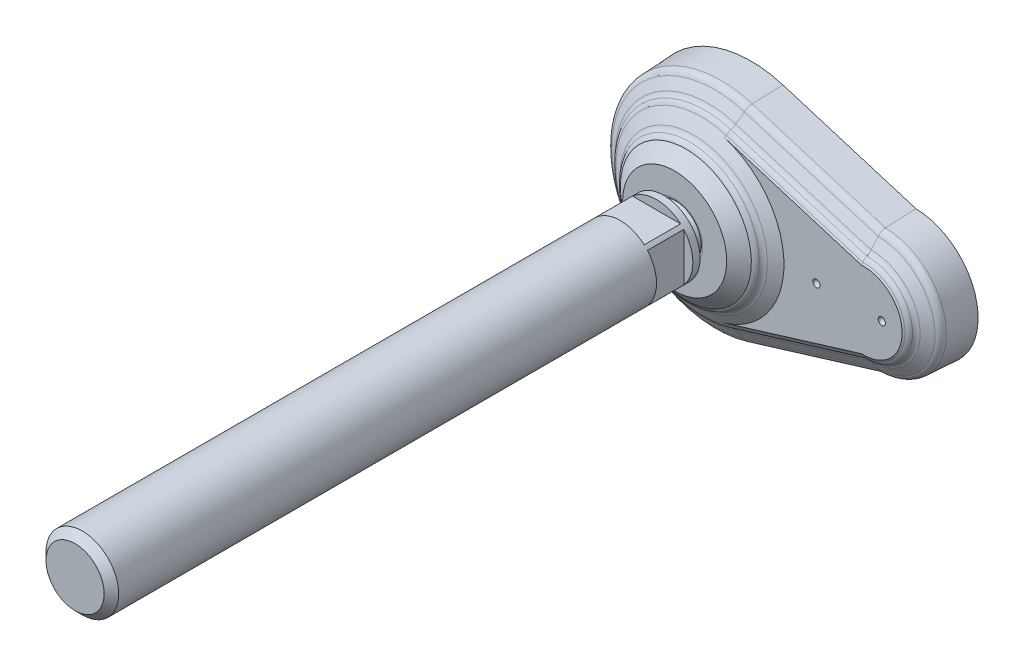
ISO-10303-21;
HEADER;
FILE_DESCRIPTION(('STEP AP214'),'2;1');
FILE_NAME('part.step','',(''),(''),'','','');
FILE_SCHEMA(('AUTOMOTIVE_DESIGN { 1 0 10303 214 1 1 1 1 }'));
ENDSEC;
DATA;
#1=APPLICATION_CONTEXT('core data for automotive mechanical design processes');
#2=APPLICATION_PROTOCOL_DEFINITION('international standard','automotive_design',2000,#1);
#3=PRODUCT_CONTEXT('',#1,'mechanical');
#4=PRODUCT('Part','Part','',(#3));
#5=PRODUCT_RELATED_PRODUCT_CATEGORY('part','',(#4));
#6=PRODUCT_DEFINITION_FORMATION('','',#4);
#7=PRODUCT_DEFINITION_CONTEXT('part definition',#1,'design');
#8=PRODUCT_DEFINITION('design','',#6,#7);
#9=PRODUCT_DEFINITION_SHAPE('','',#8);
#10=(LENGTH_UNIT() NAMED_UNIT(*) SI_UNIT(.MILLI.,.METRE.));
#11=(NAMED_UNIT(*) PLANE_ANGLE_UNIT() SI_UNIT($,.RADIAN.));
#12=(NAMED_UNIT(*) SI_UNIT($,.STERADIAN.) SOLID_ANGLE_UNIT());
#13=UNCERTAINTY_MEASURE_WITH_UNIT(LENGTH_MEASURE(1.E-05),#10,'distance_accuracy_value','');
#14=(GEOMETRIC_REPRESENTATION_CONTEXT(3) GLOBAL_UNCERTAINTY_ASSIGNED_CONTEXT((#13)) GLOBAL_UNIT_ASSIGNED_CONTEXT((#10,
#11,#12)) REPRESENTATION_CONTEXT('',''));
#15=CARTESIAN_POINT('',(0.,0.,0.));
#16=DIRECTION('',(0.,0.,1.));
#17=DIRECTION('',(1.,0.,0.));
#18=AXIS2_PLACEMENT_3D('',#15,#16,#17);
#19=CARTESIAN_POINT('',(0.,0.,38.));
#20=DIRECTION('',(0.,0.,1.));
#21=DIRECTION('',(-1.,0.,0.));
#22=AXIS2_PLACEMENT_3D('',#19,#20,#21);
#23=CYLINDRICAL_SURFACE('',#22,10.);
#24=CARTESIAN_POINT('',(0.,0.,186.));
#25=DIRECTION('',(0.,0.,1.));
#26=DIRECTION('',(-1.,0.,0.));
#27=AXIS2_PLACEMENT_3D('',#24,#25,#26);
#28=CIRCLE('',#27,10.);
#29=CARTESIAN_POINT('',(-10.,0.,186.));
#30=VERTEX_POINT('',#29);
#31=EDGE_CURVE('E9',#30,#30,#28,.F.);
#32=ORIENTED_EDGE('',*,*,#31,.T.);
#33=EDGE_LOOP('',(#32));
#34=FACE_BOUND('',#33,.T.);
#35=DIRECTION('',(0.,0.,1.));
#36=VECTOR('',#35,1.);
#37=CARTESIAN_POINT('',(7.5,-6.61437827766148,38.));
#38=LINE('',#37,#36);
#39=CARTESIAN_POINT('',(7.5,-6.61437827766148,38.));
#40=VERTEX_POINT('',#39);
#41=CARTESIAN_POINT('',(7.5,-6.61437827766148,28.));
#42=VERTEX_POINT('',#41);
#43=EDGE_CURVE('E716',#40,#42,#38,.F.);
#44=ORIENTED_EDGE('',*,*,#43,.F.);
#45=CARTESIAN_POINT('',(0.,0.,38.));
#46=DIRECTION('',(0.,0.,1.));
#47=DIRECTION('',(0.,-1.,0.));
#48=AXIS2_PLACEMENT_3D('',#45,#46,#47);
#49=CIRCLE('',#48,10.);
#50=CARTESIAN_POINT('',(7.5,6.61437827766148,38.));
#51=VERTEX_POINT('',#50);
#52=EDGE_CURVE('E242',#40,#51,#49,.T.);
#53=ORIENTED_EDGE('',*,*,#52,.T.);
#54=DIRECTION('',(0.,0.,1.));
#55=VECTOR('',#54,1.);
#56=CARTESIAN_POINT('',(7.5,6.61437827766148,38.));
#57=LINE('',#56,#55);
#58=CARTESIAN_POINT('',(7.5,6.61437827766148,28.));
#59=VERTEX_POINT('',#58);
#60=EDGE_CURVE('E205',#59,#51,#57,.T.);
#61=ORIENTED_EDGE('',*,*,#60,.F.);
#62=CARTESIAN_POINT('',(0.,0.,28.));
#63=DIRECTION('',(0.,0.,1.));
#64=DIRECTION('',(0.,-1.,0.));
#65=AXIS2_PLACEMENT_3D('',#62,#63,#64);
#66=CIRCLE('',#65,10.);
#67=EDGE_CURVE('E184',#42,#59,#66,.T.);
#68=ORIENTED_EDGE('',*,*,#67,.F.);
#69=EDGE_LOOP('',(#44,#53,#61,#68));
#70=FACE_BOUND('',#69,.T.);
#71=DIRECTION('',(0.,0.,1.));
#72=VECTOR('',#71,1.);
#73=CARTESIAN_POINT('',(6.61437827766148,7.5,38.));
#74=LINE('',#73,#72);
#75=CARTESIAN_POINT('',(6.61437827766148,7.5,38.));
#76=VERTEX_POINT('',#75);
#77=CARTESIAN_POINT('',(6.61437827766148,7.5,28.));
#78=VERTEX_POINT('',#77);
#79=EDGE_CURVE('E192',#76,#78,#74,.F.);
#80=ORIENTED_EDGE('',*,*,#79,.F.);
#81=CARTESIAN_POINT('',(-6.61437827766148,7.5,38.));
#82=VERTEX_POINT('',#81);
#83=EDGE_CURVE('E199',#76,#82,#49,.T.);
#84=ORIENTED_EDGE('',*,*,#83,.T.);
#85=DIRECTION('',(0.,0.,1.));
#86=VECTOR('',#85,1.);
#87=CARTESIAN_POINT('',(-6.61437827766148,7.5,38.));
#88=LINE('',#87,#86);
#89=CARTESIAN_POINT('',(-6.61437827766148,7.5,28.));
#90=VERTEX_POINT('',#89);
#91=EDGE_CURVE('E191',#90,#82,#88,.T.);
#92=ORIENTED_EDGE('',*,*,#91,.F.);
#93=EDGE_CURVE('E177',#78,#90,#66,.T.);
#94=ORIENTED_EDGE('',*,*,#93,.F.);
#95=EDGE_LOOP('',(#80,#84,#92,#94));
#96=FACE_BOUND('',#95,.T.);
#97=DIRECTION('',(0.,0.,1.));
#98=VECTOR('',#97,1.);
#99=CARTESIAN_POINT('',(-7.5,6.61437827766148,38.));
#100=LINE('',#99,#98);
#101=CARTESIAN_POINT('',(-7.5,6.61437827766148,38.));
#102=VERTEX_POINT('',#101);
#103=CARTESIAN_POINT('',(-7.5,6.61437827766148,28.));
#104=VERTEX_POINT('',#103);
#105=EDGE_CURVE('E200',#102,#104,#100,.F.);
#106=ORIENTED_EDGE('',*,*,#105,.F.);
#107=CARTESIAN_POINT('',(-7.5,-6.61437827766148,38.));
#108=VERTEX_POINT('',#107);
#109=EDGE_CURVE('E750',#102,#108,#49,.T.);
#110=ORIENTED_EDGE('',*,*,#109,.T.);
#111=DIRECTION('',(0.,0.,1.));
#112=VECTOR('',#111,1.);
#113=CARTESIAN_POINT('',(-7.5,-6.61437827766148,38.));
#114=LINE('',#113,#112);
#115=CARTESIAN_POINT('',(-7.5,-6.61437827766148,28.));
#116=VERTEX_POINT('',#115);
#117=EDGE_CURVE('E203',#116,#108,#114,.T.);
#118=ORIENTED_EDGE('',*,*,#117,.F.);
#119=EDGE_CURVE('E31',#104,#116,#66,.T.);
#120=ORIENTED_EDGE('',*,*,#119,.F.);
#121=EDGE_LOOP('',(#106,#110,#118,#120));
#122=FACE_BOUND('',#121,.T.);
#123=CARTESIAN_POINT('',(0.,0.,26.));
#124=DIRECTION('',(0.,0.,1.));
#125=DIRECTION('',(-1.,0.,0.));
#126=AXIS2_PLACEMENT_3D('',#123,#124,#125);
#127=CIRCLE('',#126,10.);
#128=CARTESIAN_POINT('',(-10.,0.,26.));
#129=VERTEX_POINT('',#128);
#130=EDGE_CURVE('E697',#129,#129,#127,.T.);
#131=ORIENTED_EDGE('',*,*,#130,.T.);
#132=EDGE_LOOP('',(#131));
#133=FACE_BOUND('',#132,.T.);
#134=CARTESIAN_POINT('',(-6.61437827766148,-7.5,38.));
#135=VERTEX_POINT('',#134);
#136=CARTESIAN_POINT('',(6.61437827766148,-7.5,38.));
#137=VERTEX_POINT('',#136);
#138=EDGE_CURVE('E692',#135,#137,#49,.T.);
#139=ORIENTED_EDGE('',*,*,#138,.T.);
#140=DIRECTION('',(0.,0.,1.));
#141=VECTOR('',#140,1.);
#142=CARTESIAN_POINT('',(6.61437827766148,-7.5,38.));
#143=LINE('',#142,#141);
#144=CARTESIAN_POINT('',(6.61437827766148,-7.5,28.));
#145=VERTEX_POINT('',#144);
#146=EDGE_CURVE('E712',#145,#137,#143,.T.);
#147=ORIENTED_EDGE('',*,*,#146,.F.);
#148=CARTESIAN_POINT('',(-6.61437827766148,-7.5,28.));
#149=VERTEX_POINT('',#148);
#150=EDGE_CURVE('E215',#149,#145,#66,.T.);
#151=ORIENTED_EDGE('',*,*,#150,.F.);
#152=DIRECTION('',(0.,0.,1.));
#153=VECTOR('',#152,1.);
#154=CARTESIAN_POINT('',(-6.61437827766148,-7.5,38.));
#155=LINE('',#154,#153);
#156=EDGE_CURVE('E158',#135,#149,#155,.F.);
#157=ORIENTED_EDGE('',*,*,#156,.F.);
#158=EDGE_LOOP('',(#139,#147,#151,#157));
#159=FACE_BOUND('',#158,.T.);
#160=ADVANCED_FACE('F15',(#34,#70,#96,#122,#133,#159),#23,.T.);
#161=CARTESIAN_POINT('',(0.,0.,19.6309999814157));
#162=DIRECTION('',(0.,0.,1.));
#163=DIRECTION('',(-1.,0.,0.));
#164=AXIS2_PLACEMENT_3D('',#161,#162,#163);
#165=DEGENERATE_TOROIDAL_SURFACE('',#164,0.0005038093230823,6.829,.T.);
#166=CARTESIAN_POINT('',(0.,0.,20.775));
#167=DIRECTION('',(0.,0.,-1.));
#168=DIRECTION('',(1.,0.,0.));
#169=AXIS2_PLACEMENT_3D('',#166,#167,#168);
#170=CIRCLE('',#169,6.733);
#171=CARTESIAN_POINT('',(6.733,0.,20.775));
#172=VERTEX_POINT('',#171);
#173=EDGE_CURVE('E223',#172,#172,#170,.T.);
#174=ORIENTED_EDGE('',*,*,#173,.F.);
#175=EDGE_LOOP('',(#174));
#176=FACE_BOUND('',#175,.T.);
#177=CARTESIAN_POINT('',(0.,0.,24.));
#178=DIRECTION('',(0.,0.,1.));
#179=DIRECTION('',(-1.,0.,0.));
#180=AXIS2_PLACEMENT_3D('',#177,#178,#179);
#181=CIRCLE('',#180,5.24903501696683);
#182=CARTESIAN_POINT('',(-5.24903501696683,0.,24.));
#183=VERTEX_POINT('',#182);
#184=EDGE_CURVE('E703',#183,#183,#181,.T.);
#185=ORIENTED_EDGE('',*,*,#184,.F.);
#186=EDGE_LOOP('',(#185));
#187=FACE_BOUND('',#186,.T.);
#188=ADVANCED_FACE('F471',(#176,#187),#165,.T.);
#189=CARTESIAN_POINT('',(0.,0.,38.));
#190=DIRECTION('',(0.,0.,1.));
#191=DIRECTION('',(-1.,0.,0.));
#192=AXIS2_PLACEMENT_3D('',#189,#190,#191);
#193=CYLINDRICAL_SURFACE('',#192,5.24903501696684);
#194=CARTESIAN_POINT('',(0.,0.,26.));
#195=DIRECTION('',(0.,0.,1.));
#196=DIRECTION('',(-1.,0.,0.));
#197=AXIS2_PLACEMENT_3D('',#194,#195,#196);
#198=CIRCLE('',#197,5.24903501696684);
#199=CARTESIAN_POINT('',(-5.24903501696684,0.,26.));
#200=VERTEX_POINT('',#199);
#201=EDGE_CURVE('E700',#200,#200,#198,.T.);
#202=ORIENTED_EDGE('',*,*,#201,.F.);
#203=EDGE_LOOP('',(#202));
#204=FACE_BOUND('',#203,.T.);
#205=ORIENTED_EDGE('',*,*,#184,.T.);
#206=EDGE_LOOP('',(#205));
#207=FACE_BOUND('',#206,.T.);
#208=ADVANCED_FACE('F478',(#204,#207),#193,.T.);
#209=CARTESIAN_POINT('',(-5.24903501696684,0.,26.));
#210=DIRECTION('',(0.,0.,1.));
#211=DIRECTION('',(-1.,0.,0.));
#212=AXIS2_PLACEMENT_3D('',#209,#210,#211);
#213=PLANE('',#212);
#214=ORIENTED_EDGE('',*,*,#130,.F.);
#215=EDGE_LOOP('',(#214));
#216=FACE_BOUND('',#215,.T.);
#217=ORIENTED_EDGE('',*,*,#201,.T.);
#218=EDGE_LOOP('',(#217));
#219=FACE_BOUND('',#218,.T.);
#220=ADVANCED_FACE('F766',(#216,#219),#213,.F.);
#221=CARTESIAN_POINT('',(-7.5,-7.5,28.));
#222=DIRECTION('',(0.,-1.,0.));
#223=DIRECTION('',(1.,0.,0.));
#224=AXIS2_PLACEMENT_3D('',#221,#222,#223);
#225=PLANE('',#224);
#226=ORIENTED_EDGE('',*,*,#146,.T.);
#227=DIRECTION('',(-1.,0.,0.));
#228=VECTOR('',#227,1.);
#229=CARTESIAN_POINT('',(-10.,-7.5,38.));
#230=LINE('',#229,#228);
#231=EDGE_CURVE('E706',#137,#135,#230,.T.);
#232=ORIENTED_EDGE('',*,*,#231,.T.);
#233=ORIENTED_EDGE('',*,*,#156,.T.);
#234=DIRECTION('',(1.,0.,0.));
#235=VECTOR('',#234,1.);
#236=CARTESIAN_POINT('',(-7.5,-7.5,28.));
#237=LINE('',#236,#235);
#238=EDGE_CURVE('E685',#149,#145,#237,.T.);
#239=ORIENTED_EDGE('',*,*,#238,.T.);
#240=EDGE_LOOP('',(#226,#232,#233,#239));
#241=FACE_BOUND('',#240,.T.);
#242=ADVANCED_FACE('F751',(#241),#225,.T.);
#243=CARTESIAN_POINT('',(0.,0.,28.));
#244=DIRECTION('',(0.,0.,1.));
#245=DIRECTION('',(0.,-1.,0.));
#246=AXIS2_PLACEMENT_3D('',#243,#244,#245);
#247=PLANE('',#246);
#248=ORIENTED_EDGE('',*,*,#150,.T.);
#249=ORIENTED_EDGE('',*,*,#238,.F.);
#250=EDGE_LOOP('',(#248,#249));
#251=FACE_BOUND('',#250,.T.);
#252=ADVANCED_FACE('F754',(#251),#247,.T.);
#253=CARTESIAN_POINT('',(7.5,-7.5,28.));
#254=DIRECTION('',(1.,0.,0.));
#255=DIRECTION('',(0.,1.,0.));
#256=AXIS2_PLACEMENT_3D('',#253,#254,#255);
#257=PLANE('',#256);
#258=ORIENTED_EDGE('',*,*,#60,.T.);
#259=DIRECTION('',(0.,-1.,0.));
#260=VECTOR('',#259,1.);
#261=CARTESIAN_POINT('',(7.5,0.,38.));
#262=LINE('',#261,#260);
#263=EDGE_CURVE('E710',#51,#40,#262,.T.);
#264=ORIENTED_EDGE('',*,*,#263,.T.);
#265=ORIENTED_EDGE('',*,*,#43,.T.);
#266=DIRECTION('',(0.,1.,0.));
#267=VECTOR('',#266,1.);
#268=CARTESIAN_POINT('',(7.5,-7.5,28.));
#269=LINE('',#268,#267);
#270=EDGE_CURVE('E194',#42,#59,#269,.T.);
#271=ORIENTED_EDGE('',*,*,#270,.T.);
#272=EDGE_LOOP('',(#258,#264,#265,#271));
#273=FACE_BOUND('',#272,.T.);
#274=ADVANCED_FACE('F756',(#273),#257,.T.);
#275=ORIENTED_EDGE('',*,*,#67,.T.);
#276=ORIENTED_EDGE('',*,*,#270,.F.);
#277=EDGE_LOOP('',(#275,#276));
#278=FACE_BOUND('',#277,.T.);
#279=ADVANCED_FACE('F758',(#278),#247,.T.);
#280=CARTESIAN_POINT('',(7.5,7.5,28.));
#281=DIRECTION('',(0.,1.,0.));
#282=DIRECTION('',(-1.,0.,0.));
#283=AXIS2_PLACEMENT_3D('',#280,#281,#282);
#284=PLANE('',#283);
#285=ORIENTED_EDGE('',*,*,#91,.T.);
#286=DIRECTION('',(1.,0.,0.));
#287=VECTOR('',#286,1.);
#288=CARTESIAN_POINT('',(-10.,7.5,38.));
#289=LINE('',#288,#287);
#290=EDGE_CURVE('E216',#82,#76,#289,.T.);
#291=ORIENTED_EDGE('',*,*,#290,.T.);
#292=ORIENTED_EDGE('',*,*,#79,.T.);
#293=DIRECTION('',(-1.,0.,0.));
#294=VECTOR('',#293,1.);
#295=CARTESIAN_POINT('',(7.5,7.5,28.));
#296=LINE('',#295,#294);
#297=EDGE_CURVE('E180',#78,#90,#296,.T.);
#298=ORIENTED_EDGE('',*,*,#297,.T.);
#299=EDGE_LOOP('',(#285,#291,#292,#298));
#300=FACE_BOUND('',#299,.T.);
#301=ADVANCED_FACE('F188',(#300),#284,.T.);
#302=ORIENTED_EDGE('',*,*,#93,.T.);
#303=ORIENTED_EDGE('',*,*,#297,.F.);
#304=EDGE_LOOP('',(#302,#303));
#305=FACE_BOUND('',#304,.T.);
#306=ADVANCED_FACE('F179',(#305),#247,.T.);
#307=DIRECTION('',(0.,-1.,0.));
#308=VECTOR('',#307,1.);
#309=CARTESIAN_POINT('',(-7.5,7.5,28.));
#310=LINE('',#309,#308);
#311=EDGE_CURVE('E193',#104,#116,#310,.T.);
#312=ORIENTED_EDGE('',*,*,#311,.F.);
#313=ORIENTED_EDGE('',*,*,#119,.T.);
#314=EDGE_LOOP('',(#312,#313));
#315=FACE_BOUND('',#314,.T.);
#316=ADVANCED_FACE('F759',(#315),#247,.T.);
#317=CARTESIAN_POINT('',(-7.5,7.5,28.));
#318=DIRECTION('',(-1.,0.,0.));
#319=DIRECTION('',(0.,-1.,0.));
#320=AXIS2_PLACEMENT_3D('',#317,#318,#319);
#321=PLANE('',#320);
#322=ORIENTED_EDGE('',*,*,#117,.T.);
#323=DIRECTION('',(0.,1.,0.));
#324=VECTOR('',#323,1.);
#325=CARTESIAN_POINT('',(-7.5,0.,38.));
#326=LINE('',#325,#324);
#327=EDGE_CURVE('E212',#108,#102,#326,.T.);
#328=ORIENTED_EDGE('',*,*,#327,.T.);
#329=ORIENTED_EDGE('',*,*,#105,.T.);
#330=ORIENTED_EDGE('',*,*,#311,.T.);
#331=EDGE_LOOP('',(#322,#328,#329,#330));
#332=FACE_BOUND('',#331,.T.);
#333=ADVANCED_FACE('F772',(#332),#321,.T.);
#334=CARTESIAN_POINT('',(0.,0.,0.));
#335=DIRECTION('',(0.,0.,1.));
#336=DIRECTION('',(0.,-1.,0.));
#337=AXIS2_PLACEMENT_3D('',#334,#335,#336);
#338=PLANE('',#337);
#339=DIRECTION('',(-0.950373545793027,0.311111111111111,0.));
#340=VECTOR('',#339,1.);
#341=CARTESIAN_POINT('',(48.7333333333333,11.4044825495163,0.));
#342=LINE('',#341,#340);
#343=CARTESIAN_POINT('',(48.7333333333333,11.4044825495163,0.));
#344=VERTEX_POINT('',#343);
#345=CARTESIAN_POINT('',(8.08888888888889,24.7097121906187,0.));
#346=VERTEX_POINT('',#345);
#347=EDGE_CURVE('E226',#344,#346,#342,.T.);
#348=ORIENTED_EDGE('',*,*,#347,.F.);
#349=CARTESIAN_POINT('',(45.,0.,0.));
#350=DIRECTION('',(0.,0.,1.));
#351=DIRECTION('',(1.,0.,0.));
#352=AXIS2_PLACEMENT_3D('',#349,#350,#351);
#353=CIRCLE('',#352,12.);
#354=CARTESIAN_POINT('',(48.7333333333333,-11.4044825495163,0.));
#355=VERTEX_POINT('',#354);
#356=EDGE_CURVE('E236',#355,#344,#353,.T.);
#357=ORIENTED_EDGE('',*,*,#356,.F.);
#358=DIRECTION('',(0.950373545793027,0.311111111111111,0.));
#359=VECTOR('',#358,1.);
#360=CARTESIAN_POINT('',(8.08888888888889,-24.7097121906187,0.));
#361=LINE('',#360,#359);
#362=CARTESIAN_POINT('',(8.08888888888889,-24.7097121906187,0.));
#363=VERTEX_POINT('',#362);
#364=EDGE_CURVE('E233',#363,#355,#361,.T.);
#365=ORIENTED_EDGE('',*,*,#364,.F.);
#366=CARTESIAN_POINT('',(0.,0.,0.));
#367=DIRECTION('',(0.,0.,1.));
#368=DIRECTION('',(1.,0.,0.));
#369=AXIS2_PLACEMENT_3D('',#366,#367,#368);
#370=CIRCLE('',#369,26.);
#371=EDGE_CURVE('E229',#346,#363,#370,.T.);
#372=ORIENTED_EDGE('',*,*,#371,.F.);
#373=EDGE_LOOP('',(#348,#357,#365,#372));
#374=FACE_BOUND('',#373,.T.);
#375=ADVANCED_FACE('F481',(#374),#338,.F.);
#376=CARTESIAN_POINT('',(8.08888888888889,-24.7097121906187,0.));
#377=DIRECTION('',(0.311111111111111,-0.950373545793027,0.));
#378=DIRECTION('',(0.950373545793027,0.311111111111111,0.));
#379=AXIS2_PLACEMENT_3D('',#376,#377,#378);
#380=PLANE('',#379);
#381=DIRECTION('',(0.950373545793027,0.311111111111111,0.));
#382=VECTOR('',#381,1.);
#383=CARTESIAN_POINT('',(8.08888888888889,-24.7097121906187,2.));
#384=LINE('',#383,#382);
#385=CARTESIAN_POINT('',(8.08888888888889,-24.7097121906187,2.));
#386=VERTEX_POINT('',#385);
#387=CARTESIAN_POINT('',(48.7333333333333,-11.4044825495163,2.));
#388=VERTEX_POINT('',#387);
#389=EDGE_CURVE('E245',#386,#388,#384,.T.);
#390=ORIENTED_EDGE('',*,*,#389,.F.);
#391=DIRECTION('',(0.,0.,1.));
#392=VECTOR('',#391,1.);
#393=CARTESIAN_POINT('',(8.08888888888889,-24.7097121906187,0.));
#394=LINE('',#393,#392);
#395=EDGE_CURVE('E253',#363,#386,#394,.T.);
#396=ORIENTED_EDGE('',*,*,#395,.F.);
#397=ORIENTED_EDGE('',*,*,#364,.T.);
#398=DIRECTION('',(0.,0.,1.));
#399=VECTOR('',#398,1.);
#400=CARTESIAN_POINT('',(48.7333333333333,-11.4044825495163,0.));
#401=LINE('',#400,#399);
#402=EDGE_CURVE('E251',#355,#388,#401,.T.);
#403=ORIENTED_EDGE('',*,*,#402,.T.);
#404=EDGE_LOOP('',(#390,#396,#397,#403));
#405=FACE_BOUND('',#404,.T.);
#406=ADVANCED_FACE('F1030',(#405),#380,.T.);
#407=CARTESIAN_POINT('',(0.,0.,0.));
#408=DIRECTION('',(0.,0.,1.));
#409=DIRECTION('',(0.,-1.,0.));
#410=AXIS2_PLACEMENT_3D('',#407,#408,#409);
#411=CYLINDRICAL_SURFACE('',#410,26.);
#412=CARTESIAN_POINT('',(0.,0.,2.));
#413=DIRECTION('',(0.,0.,1.));
#414=DIRECTION('',(1.,0.,0.));
#415=AXIS2_PLACEMENT_3D('',#412,#413,#414);
#416=CIRCLE('',#415,26.);
#417=CARTESIAN_POINT('',(8.08888888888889,24.7097121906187,2.));
#418=VERTEX_POINT('',#417);
#419=EDGE_CURVE('E241',#418,#386,#416,.T.);
#420=ORIENTED_EDGE('',*,*,#419,.F.);
#421=DIRECTION('',(0.,0.,1.));
#422=VECTOR('',#421,1.);
#423=CARTESIAN_POINT('',(8.08888888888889,24.7097121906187,0.));
#424=LINE('',#423,#422);
#425=EDGE_CURVE('E255',#346,#418,#424,.T.);
#426=ORIENTED_EDGE('',*,*,#425,.F.);
#427=ORIENTED_EDGE('',*,*,#371,.T.);
#428=ORIENTED_EDGE('',*,*,#395,.T.);
#429=EDGE_LOOP('',(#420,#426,#427,#428));
#430=FACE_BOUND('',#429,.T.);
#431=ADVANCED_FACE('F1038',(#430),#411,.T.);
#432=CARTESIAN_POINT('',(48.7333333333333,11.4044825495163,0.));
#433=DIRECTION('',(0.311111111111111,0.950373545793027,0.));
#434=DIRECTION('',(-0.950373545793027,0.311111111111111,0.));
#435=AXIS2_PLACEMENT_3D('',#432,#433,#434);
#436=PLANE('',#435);
#437=DIRECTION('',(-0.950373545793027,0.311111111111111,0.));
#438=VECTOR('',#437,1.);
#439=CARTESIAN_POINT('',(48.7333333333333,11.4044825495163,2.));
#440=LINE('',#439,#438);
#441=CARTESIAN_POINT('',(48.7333333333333,11.4044825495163,2.));
#442=VERTEX_POINT('',#441);
#443=EDGE_CURVE('E149',#442,#418,#440,.T.);
#444=ORIENTED_EDGE('',*,*,#443,.F.);
#445=DIRECTION('',(0.,0.,1.));
#446=VECTOR('',#445,1.);
#447=CARTESIAN_POINT('',(48.7333333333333,11.4044825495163,0.));
#448=LINE('',#447,#446);
#449=EDGE_CURVE('E239',#344,#442,#448,.T.);
#450=ORIENTED_EDGE('',*,*,#449,.F.);
#451=ORIENTED_EDGE('',*,*,#347,.T.);
#452=ORIENTED_EDGE('',*,*,#425,.T.);
#453=EDGE_LOOP('',(#444,#450,#451,#452));
#454=FACE_BOUND('',#453,.T.);
#455=ADVANCED_FACE('F505',(#454),#436,.T.);
#456=CARTESIAN_POINT('',(45.,0.,0.));
#457=DIRECTION('',(0.,0.,1.));
#458=DIRECTION('',(0.,-1.,0.));
#459=AXIS2_PLACEMENT_3D('',#456,#457,#458);
#460=CYLINDRICAL_SURFACE('',#459,12.);
#461=CARTESIAN_POINT('',(45.,0.,2.));
#462=DIRECTION('',(0.,0.,1.));
#463=DIRECTION('',(1.,0.,0.));
#464=AXIS2_PLACEMENT_3D('',#461,#462,#463);
#465=CIRCLE('',#464,12.);
#466=EDGE_CURVE('E230',#388,#442,#465,.T.);
#467=ORIENTED_EDGE('',*,*,#466,.F.);
#468=ORIENTED_EDGE('',*,*,#402,.F.);
#469=ORIENTED_EDGE('',*,*,#356,.T.);
#470=ORIENTED_EDGE('',*,*,#449,.T.);
#471=EDGE_LOOP('',(#467,#468,#469,#470));
#472=FACE_BOUND('',#471,.T.);
#473=ADVANCED_FACE('F491',(#472),#460,.T.);
#474=CARTESIAN_POINT('',(45.,0.,2.));
#475=DIRECTION('',(0.,0.,-1.));
#476=DIRECTION('',(0.,1.,0.));
#477=AXIS2_PLACEMENT_3D('',#474,#475,#476);
#478=CONICAL_SURFACE('',#477,17.5,0.0523365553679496);
#479=CARTESIAN_POINT('',(45.,0.,10.304));
#480=DIRECTION('',(0.,0.,1.));
#481=DIRECTION('',(0.,-1.,0.));
#482=AXIS2_PLACEMENT_3D('',#479,#480,#481);
#483=CIRCLE('',#482,17.065);
#484=CARTESIAN_POINT('',(45.3136024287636,-17.0621182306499,10.304));
#485=VERTEX_POINT('',#484);
#486=CARTESIAN_POINT('',(45.3136024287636,17.0621182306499,10.304));
#487=VERTEX_POINT('',#486);
#488=EDGE_CURVE('E304',#485,#487,#483,.T.);
#489=ORIENTED_EDGE('',*,*,#488,.F.);
#490=CARTESIAN_POINT('',(45.3136007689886,-17.0621077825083,10.3042));
#491=CARTESIAN_POINT('',(45.3250873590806,-17.134412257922,8.92013380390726));
#492=CARTESIAN_POINT('',(45.3366049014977,-17.206707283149,7.5360673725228));
#493=CARTESIAN_POINT('',(45.3597018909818,-17.3512784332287,4.76793403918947));
#494=CARTESIAN_POINT('',(45.3712813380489,-17.4235545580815,3.38386713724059));
#495=CARTESIAN_POINT('',(45.3828917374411,-17.4958212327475,1.9998));
#496=B_SPLINE_CURVE_WITH_KNOTS('',3,(#490,#491,#492,#493,#494,#495),.UNSPECIFIED.,.F.,.F.,(4,2,
4),(0.,4.15800336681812,8.31600673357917),.UNSPECIFIED.);
#497=CARTESIAN_POINT('',(45.3828900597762,-17.4958107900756,2.));
#498=VERTEX_POINT('',#497);
#499=EDGE_CURVE('E617',#485,#498,#496,.T.);
#500=ORIENTED_EDGE('',*,*,#499,.T.);
#501=CARTESIAN_POINT('',(45.,0.,2.));
#502=DIRECTION('',(0.,0.,1.));
#503=DIRECTION('',(0.,-1.,0.));
#504=AXIS2_PLACEMENT_3D('',#501,#502,#503);
#505=CIRCLE('',#504,17.5);
#506=CARTESIAN_POINT('',(45.3828900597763,17.4958107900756,2.));
#507=VERTEX_POINT('',#506);
#508=EDGE_CURVE('E307',#498,#507,#505,.T.);
#509=ORIENTED_EDGE('',*,*,#508,.T.);
#510=CARTESIAN_POINT('',(45.3828917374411,17.4958212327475,1.9998));
#511=CARTESIAN_POINT('',(45.371281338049,17.4235545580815,3.38386713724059));
#512=CARTESIAN_POINT('',(45.359701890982,17.3512784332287,4.76793403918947));
#513=CARTESIAN_POINT('',(45.3366049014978,17.206707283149,7.5360673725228));
#514=CARTESIAN_POINT('',(45.3250873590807,17.134412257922,8.92013380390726));
#515=CARTESIAN_POINT('',(45.3136007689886,17.0621077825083,10.3042));
#516=B_SPLINE_CURVE_WITH_KNOTS('',3,(#510,#511,#512,#513,#514,#515),.UNSPECIFIED.,.F.,.F.,(4,2,
4),(0.,4.15800336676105,8.31600673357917),.UNSPECIFIED.);
#517=EDGE_CURVE('E633',#507,#487,#516,.T.);
#518=ORIENTED_EDGE('',*,*,#517,.T.);
#519=EDGE_LOOP('',(#489,#500,#509,#518));
#520=FACE_BOUND('',#519,.T.);
#521=ADVANCED_FACE('F367',(#520),#478,.T.);
#522=CARTESIAN_POINT('',(46.8961596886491,-16.5782819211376,10.304));
#523=DIRECTION('',(-0.291971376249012,0.9549953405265,-0.0523126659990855));
#524=DIRECTION('',(-0.956304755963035,-0.292371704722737,0.));
#525=AXIS2_PLACEMENT_3D('',#522,#523,#524);
#526=PLANE('',#525);
#527=ORIENTED_EDGE('',*,*,#499,.F.);
#528=DIRECTION('',(-0.956304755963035,-0.292371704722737,0.));
#529=VECTOR('',#528,1.);
#530=CARTESIAN_POINT('',(46.8961596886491,-16.5782819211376,10.304));
#531=LINE('',#530,#529);
#532=CARTESIAN_POINT('',(8.64396945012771,-28.2731501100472,10.304));
#533=VERTEX_POINT('',#532);
#534=EDGE_CURVE('E565',#485,#533,#531,.T.);
#535=ORIENTED_EDGE('',*,*,#534,.T.);
#536=DIRECTION('',(-0.0152947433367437,0.050026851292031,0.998630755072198));
#537=VECTOR('',#536,1.);
#538=CARTESIAN_POINT('',(8.7711511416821,-28.689142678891,2.));
#539=LINE('',#538,#537);
#540=CARTESIAN_POINT('',(8.7711511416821,-28.689142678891,2.));
#541=VERTEX_POINT('',#540);
#542=EDGE_CURVE('E571',#541,#533,#539,.T.);
#543=ORIENTED_EDGE('',*,*,#542,.F.);
#544=DIRECTION('',(-0.956304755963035,-0.292371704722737,0.));
#545=VECTOR('',#544,1.);
#546=CARTESIAN_POINT('',(47.0233413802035,-16.9942744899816,2.));
#547=LINE('',#546,#545);
#548=EDGE_CURVE('E143',#498,#541,#547,.T.);
#549=ORIENTED_EDGE('',*,*,#548,.F.);
#550=EDGE_LOOP('',(#527,#535,#543,#549));
#551=FACE_BOUND('',#550,.T.);
#552=ADVANCED_FACE('F474',(#551),#526,.F.);
#553=CARTESIAN_POINT('',(0.,0.,2.));
#554=DIRECTION('',(0.,0.,1.));
#555=DIRECTION('',(0.,-1.,0.));
#556=AXIS2_PLACEMENT_3D('',#553,#554,#555);
#557=PLANE('',#556);
#558=ORIENTED_EDGE('',*,*,#466,.T.);
#559=ORIENTED_EDGE('',*,*,#443,.T.);
#560=ORIENTED_EDGE('',*,*,#419,.T.);
#561=ORIENTED_EDGE('',*,*,#389,.T.);
#562=EDGE_LOOP('',(#558,#559,#560,#561));
#563=FACE_BOUND('',#562,.T.);
#564=DIRECTION('',(-0.956304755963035,0.292371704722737,0.));
#565=VECTOR('',#564,1.);
#566=CARTESIAN_POINT('',(47.0233413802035,16.9942744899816,2.));
#567=LINE('',#566,#565);
#568=CARTESIAN_POINT('',(8.7711511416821,28.689142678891,2.));
#569=VERTEX_POINT('',#568);
#570=EDGE_CURVE('E620',#507,#569,#567,.T.);
#571=ORIENTED_EDGE('',*,*,#570,.F.);
#572=ORIENTED_EDGE('',*,*,#508,.F.);
#573=ORIENTED_EDGE('',*,*,#548,.T.);
#574=CARTESIAN_POINT('',(0.,0.,2.));
#575=DIRECTION('',(0.,0.,1.));
#576=DIRECTION('',(0.,-1.,0.));
#577=AXIS2_PLACEMENT_3D('',#574,#575,#576);
#578=CIRCLE('',#577,30.);
#579=EDGE_CURVE('E355',#569,#541,#578,.T.);
#580=ORIENTED_EDGE('',*,*,#579,.F.);
#581=EDGE_LOOP('',(#571,#572,#573,#580));
#582=FACE_BOUND('',#581,.T.);
#583=ADVANCED_FACE('F365',(#563,#582),#557,.F.);
#584=CARTESIAN_POINT('',(47.0233413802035,16.9942744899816,2.));
#585=DIRECTION('',(-0.291971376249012,-0.9549953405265,-0.0523126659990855));
#586=DIRECTION('',(0.956304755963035,-0.292371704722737,0.));
#587=AXIS2_PLACEMENT_3D('',#584,#585,#586);
#588=PLANE('',#587);
#589=ORIENTED_EDGE('',*,*,#517,.F.);
#590=ORIENTED_EDGE('',*,*,#570,.T.);
#591=DIRECTION('',(-0.0152947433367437,-0.050026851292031,0.998630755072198));
#592=VECTOR('',#591,1.);
#593=CARTESIAN_POINT('',(8.7711511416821,28.689142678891,2.));
#594=LINE('',#593,#592);
#595=CARTESIAN_POINT('',(8.64396945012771,28.2731501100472,10.304));
#596=VERTEX_POINT('',#595);
#597=EDGE_CURVE('E585',#569,#596,#594,.T.);
#598=ORIENTED_EDGE('',*,*,#597,.T.);
#599=DIRECTION('',(-0.956304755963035,0.292371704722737,0.));
#600=VECTOR('',#599,1.);
#601=CARTESIAN_POINT('',(46.8961596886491,16.5782819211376,10.304));
#602=LINE('',#601,#600);
#603=EDGE_CURVE('E621',#487,#596,#602,.T.);
#604=ORIENTED_EDGE('',*,*,#603,.F.);
#605=EDGE_LOOP('',(#589,#590,#598,#604));
#606=FACE_BOUND('',#605,.T.);
#607=ADVANCED_FACE('F443',(#606),#588,.F.);
#608=CARTESIAN_POINT('',(45.,0.,10.2086896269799));
#609=DIRECTION('',(0.,0.,1.));
#610=DIRECTION('',(0.,-1.,0.));
#611=AXIS2_PLACEMENT_3D('',#608,#609,#610);
#612=TOROIDAL_SURFACE('',#611,15.0672723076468,2.);
#613=CARTESIAN_POINT('',(45.313603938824,-17.062127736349,10.3038));
#614=CARTESIAN_POINT('',(45.3131828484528,-17.0594763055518,10.3596419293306));
#615=CARTESIAN_POINT('',(45.3123906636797,-17.0544900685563,10.4153431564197));
#616=CARTESIAN_POINT('',(45.3100724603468,-17.0398916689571,10.5261166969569));
#617=CARTESIAN_POINT('',(45.3085464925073,-17.0302798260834,10.5811890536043));
#618=CARTESIAN_POINT('',(45.3028875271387,-16.9946160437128,10.7447437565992));
#619=CARTESIAN_POINT('',(45.2976717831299,-16.9617253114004,10.8517806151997));
#620=CARTESIAN_POINT('',(45.284530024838,-16.8786837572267,11.0587251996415));
#621=CARTESIAN_POINT('',(45.2766032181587,-16.8285278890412,11.1586308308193));
#622=CARTESIAN_POINT('',(45.2583029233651,-16.7124179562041,11.348570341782));
#623=CARTESIAN_POINT('',(45.24792931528,-16.6464631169,11.4386037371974));
#624=CARTESIAN_POINT('',(45.2250216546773,-16.5003240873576,11.6067133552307));
#625=CARTESIAN_POINT('',(45.2124772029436,-16.4200713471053,11.684728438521));
#626=CARTESIAN_POINT('',(45.1856662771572,-16.2478592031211,11.8261370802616));
#627=CARTESIAN_POINT('',(45.1714009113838,-16.1559073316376,11.8895399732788));
#628=CARTESIAN_POINT('',(45.148748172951,-16.0092275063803,11.9735680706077));
#629=CARTESIAN_POINT('',(45.1408156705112,-15.957749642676,12.0001426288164));
#630=CARTESIAN_POINT('',(45.1246863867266,-15.8528232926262,12.0486569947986));
#631=CARTESIAN_POINT('',(45.1164901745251,-15.7993790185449,12.0706061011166));
#632=CARTESIAN_POINT('',(45.1081834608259,-15.7450737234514,12.0902));
#633=B_SPLINE_CURVE_WITH_KNOTS('',3,(#613,#614,#615,#616,#617,#618,#619,#620,#621,#622,#623,
#624,#625,#626,#627,#628,#629,#630,#631,#632),.UNSPECIFIED.,.F.,.F.,(4,2,2,2,2,2,2,2,2,4),(0.,
0.167615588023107,0.335219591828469,0.669784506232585,1.00444729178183,1.33912648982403,
1.67545571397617,2.01156948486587,2.1867983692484,2.36167155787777),.UNSPECIFIED.);
#634=CARTESIAN_POINT('',(45.108268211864,-15.7456277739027,12.09));
#635=VERTEX_POINT('',#634);
#636=EDGE_CURVE('E639',#485,#635,#633,.T.);
#637=ORIENTED_EDGE('',*,*,#636,.F.);
#638=ORIENTED_EDGE('',*,*,#488,.T.);
#639=CARTESIAN_POINT('',(45.1081834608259,15.7450737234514,12.0902));
#640=CARTESIAN_POINT('',(45.1162755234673,15.7979756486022,12.0711117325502));
#641=CARTESIAN_POINT('',(45.1242625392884,15.8500594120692,12.0497900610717));
#642=CARTESIAN_POINT('',(45.1399729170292,15.9522733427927,12.0028085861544));
#643=CARTESIAN_POINT('',(45.1476962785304,16.0024035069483,11.9771487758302));
#644=CARTESIAN_POINT('',(45.170371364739,16.1492634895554,11.8939254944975));
#645=CARTESIAN_POINT('',(45.1848488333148,16.2425982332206,11.8300692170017));
#646=CARTESIAN_POINT('',(45.2120467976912,16.4173167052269,11.6873614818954));
#647=CARTESIAN_POINT('',(45.2247661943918,16.4986929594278,11.6085007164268));
#648=CARTESIAN_POINT('',(45.2480269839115,16.647087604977,11.4379734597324));
#649=CARTESIAN_POINT('',(45.2585686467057,16.7141077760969,11.3463085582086));
#650=CARTESIAN_POINT('',(45.2770522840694,16.8313730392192,11.1534556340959));
#651=CARTESIAN_POINT('',(45.2850114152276,16.8817288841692,11.0523364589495));
#652=CARTESIAN_POINT('',(45.298151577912,16.9647535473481,10.8429463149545));
#653=CARTESIAN_POINT('',(45.3033350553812,16.9974379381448,10.7346817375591));
#654=CARTESIAN_POINT('',(45.3088197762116,17.0320013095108,10.5716792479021));
#655=CARTESIAN_POINT('',(45.3102579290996,17.0410597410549,10.5184099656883));
#656=CARTESIAN_POINT('',(45.3124461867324,17.0548396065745,10.411403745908));
#657=CARTESIAN_POINT('',(45.3131976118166,17.0595693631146,10.3576679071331));
#658=CARTESIAN_POINT('',(45.313603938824,17.062127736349,10.3038));
#659=B_SPLINE_CURVE_WITH_KNOTS('',3,(#639,#640,#641,#642,#643,#644,#645,#646,#647,#648,#649,
#650,#651,#652,#653,#654,#655,#656,#657,#658),.UNSPECIFIED.,.F.,.F.,(4,2,2,2,2,2,2,2,2,4),(0.,
0.170355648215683,0.340711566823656,0.680992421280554,1.02148505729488,1.36193545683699,
1.70007548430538,2.03791704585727,2.19992239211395,2.36161559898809),.UNSPECIFIED.);
#660=CARTESIAN_POINT('',(45.1082682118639,15.7456277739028,12.09));
#661=VERTEX_POINT('',#660);
#662=EDGE_CURVE('E432',#661,#487,#659,.T.);
#663=ORIENTED_EDGE('',*,*,#662,.F.);
#664=CARTESIAN_POINT('',(45.,0.,12.09));
#665=DIRECTION('',(0.,0.,1.));
#666=DIRECTION('',(0.,-1.,0.));
#667=AXIS2_PLACEMENT_3D('',#664,#665,#666);
#668=CIRCLE('',#667,15.746);
#669=EDGE_CURVE('E301',#635,#661,#668,.T.);
#670=ORIENTED_EDGE('',*,*,#669,.F.);
#671=EDGE_LOOP('',(#637,#638,#663,#670));
#672=FACE_BOUND('',#671,.T.);
#673=ADVANCED_FACE('F416',(#672),#612,.T.);
#674=CARTESIAN_POINT('',(46.312080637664,-14.6678454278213,10.2086896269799));
#675=DIRECTION('',(-0.956304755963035,-0.292371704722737,0.));
#676=DIRECTION('',(0.292371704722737,-0.956304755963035,0.));
#677=AXIS2_PLACEMENT_3D('',#674,#675,#676);
#678=CYLINDRICAL_SURFACE('',#677,2.);
#679=ORIENTED_EDGE('',*,*,#534,.F.);
#680=ORIENTED_EDGE('',*,*,#636,.T.);
#681=DIRECTION('',(-0.956304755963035,-0.292371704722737,0.));
#682=VECTOR('',#681,1.);
#683=CARTESIAN_POINT('',(46.5105214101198,-15.3169159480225,12.09));
#684=LINE('',#683,#682);
#685=CARTESIAN_POINT('',(8.25833117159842,-27.0117841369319,12.09));
#686=VERTEX_POINT('',#685);
#687=EDGE_CURVE('E562',#635,#686,#684,.T.);
#688=ORIENTED_EDGE('',*,*,#687,.T.);
#689=CARTESIAN_POINT('',(8.05989039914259,-26.3627136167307,10.2086896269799));
#690=DIRECTION('',(0.956304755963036,0.292371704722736,0.));
#691=DIRECTION('',(-0.292371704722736,0.956304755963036,0.));
#692=AXIS2_PLACEMENT_3D('',#689,#690,#691);
#693=CIRCLE('',#692,2.);
#694=EDGE_CURVE('E574',#686,#533,#693,.T.);
#695=ORIENTED_EDGE('',*,*,#694,.T.);
#696=EDGE_LOOP('',(#679,#680,#688,#695));
#697=FACE_BOUND('',#696,.T.);
#698=ADVANCED_FACE('F444',(#697),#678,.T.);
#699=CARTESIAN_POINT('',(0.,0.,2.));
#700=DIRECTION('',(0.,0.,-1.));
#701=DIRECTION('',(0.,1.,0.));
#702=AXIS2_PLACEMENT_3D('',#699,#700,#701);
#703=CONICAL_SURFACE('',#702,30.,0.0523365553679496);
#704=CARTESIAN_POINT('',(0.,0.,10.304));
#705=DIRECTION('',(0.,0.,1.));
#706=DIRECTION('',(0.,-1.,0.));
#707=AXIS2_PLACEMENT_3D('',#704,#705,#706);
#708=CIRCLE('',#707,29.565);
#709=EDGE_CURVE('E605',#596,#533,#708,.T.);
#710=ORIENTED_EDGE('',*,*,#709,.F.);
#711=ORIENTED_EDGE('',*,*,#597,.F.);
#712=ORIENTED_EDGE('',*,*,#579,.T.);
#713=ORIENTED_EDGE('',*,*,#542,.T.);
#714=EDGE_LOOP('',(#710,#711,#712,#713));
#715=FACE_BOUND('',#714,.T.);
#716=ADVANCED_FACE('F464',(#715),#703,.T.);
#717=CARTESIAN_POINT('',(46.312080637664,14.6678454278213,10.2086896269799));
#718=DIRECTION('',(-0.956304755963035,0.292371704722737,0.));
#719=DIRECTION('',(-0.292371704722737,-0.956304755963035,0.));
#720=AXIS2_PLACEMENT_3D('',#717,#718,#719);
#721=CYLINDRICAL_SURFACE('',#720,2.);
#722=DIRECTION('',(-0.956304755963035,0.292371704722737,0.));
#723=VECTOR('',#722,1.);
#724=CARTESIAN_POINT('',(46.5105214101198,15.3169159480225,12.09));
#725=LINE('',#724,#723);
#726=CARTESIAN_POINT('',(8.25833117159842,27.0117841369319,12.09));
#727=VERTEX_POINT('',#726);
#728=EDGE_CURVE('E551',#661,#727,#725,.T.);
#729=ORIENTED_EDGE('',*,*,#728,.F.);
#730=ORIENTED_EDGE('',*,*,#662,.T.);
#731=ORIENTED_EDGE('',*,*,#603,.T.);
#732=CARTESIAN_POINT('',(8.05989039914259,26.3627136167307,10.2086896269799));
#733=DIRECTION('',(-0.956304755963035,0.292371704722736,0.));
#734=DIRECTION('',(-0.292371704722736,-0.956304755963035,0.));
#735=AXIS2_PLACEMENT_3D('',#732,#733,#734);
#736=CIRCLE('',#735,2.);
#737=EDGE_CURVE('E588',#727,#596,#736,.T.);
#738=ORIENTED_EDGE('',*,*,#737,.F.);
#739=EDGE_LOOP('',(#729,#730,#731,#738));
#740=FACE_BOUND('',#739,.T.);
#741=ADVANCED_FACE('F375',(#740),#721,.T.);
#742=CARTESIAN_POINT('',(45.,0.,12.09));
#743=DIRECTION('',(0.,0.,-1.));
#744=DIRECTION('',(0.,1.,0.));
#745=AXIS2_PLACEMENT_3D('',#742,#743,#744);
#746=CONICAL_SURFACE('',#745,15.746,0.993858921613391);
#747=CARTESIAN_POINT('',(45.,0.,13.7170000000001));
#748=DIRECTION('',(0.,0.,1.));
#749=DIRECTION('',(0.,-1.,0.));
#750=AXIS2_PLACEMENT_3D('',#747,#748,#749);
#751=CIRCLE('',#750,13.2459999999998);
#752=CARTESIAN_POINT('',(44.7416637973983,-13.243480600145,13.7170000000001));
#753=VERTEX_POINT('',#752);
#754=CARTESIAN_POINT('',(44.7416637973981,13.2434806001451,13.7170000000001));
#755=VERTEX_POINT('',#754);
#756=EDGE_CURVE('E299',#753,#755,#751,.T.);
#757=ORIENTED_EDGE('',*,*,#756,.F.);
#758=CARTESIAN_POINT('',(44.7416208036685,-13.2431723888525,13.7172000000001));
#759=CARTESIAN_POINT('',(44.8000092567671,-13.66082442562,13.4461588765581));
#760=CARTESIAN_POINT('',(44.8597613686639,-14.078214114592,13.1750215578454));
#761=CARTESIAN_POINT('',(44.9819928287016,-14.9124682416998,12.6325548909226));
#762=CARTESIAN_POINT('',(45.0444721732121,-15.3293326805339,12.3612255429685));
#763=CARTESIAN_POINT('',(45.1083151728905,-15.745934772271,12.0898));
#764=B_SPLINE_CURVE_WITH_KNOTS('',3,(#758,#759,#760,#761,#762,#763),.UNSPECIFIED.,.F.,.F.,(4,2,
4),(0.,1.50389468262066,3.0077873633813),.UNSPECIFIED.);
#765=EDGE_CURVE('E425',#753,#635,#764,.T.);
#766=ORIENTED_EDGE('',*,*,#765,.T.);
#767=ORIENTED_EDGE('',*,*,#669,.T.);
#768=CARTESIAN_POINT('',(45.1083151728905,15.745934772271,12.0898));
#769=CARTESIAN_POINT('',(45.0444721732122,15.3293326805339,12.3612255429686));
#770=CARTESIAN_POINT('',(44.9819928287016,14.9124682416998,12.6325548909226));
#771=CARTESIAN_POINT('',(44.8597613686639,14.078214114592,13.1750215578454));
#772=CARTESIAN_POINT('',(44.8000092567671,13.66082442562,13.4461588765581));
#773=CARTESIAN_POINT('',(44.7416208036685,13.2431723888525,13.7172000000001));
#774=B_SPLINE_CURVE_WITH_KNOTS('',3,(#768,#769,#770,#771,#772,#773),.UNSPECIFIED.,.F.,.F.,(4,2,
4),(0.,1.50389268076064,3.0077873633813),.UNSPECIFIED.);
#775=EDGE_CURVE('E419',#661,#755,#774,.T.);
#776=ORIENTED_EDGE('',*,*,#775,.T.);
#777=EDGE_LOOP('',(#757,#766,#767,#776));
#778=FACE_BOUND('',#777,.T.);
#779=ADVANCED_FACE('F410',(#778),#746,.T.);
#780=CARTESIAN_POINT('',(45.7795921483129,-12.9261540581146,13.7170000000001));
#781=DIRECTION('',(-0.159476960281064,0.521625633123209,-0.838137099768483));
#782=DIRECTION('',(0.,0.849002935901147,0.528388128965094));
#783=AXIS2_PLACEMENT_3D('',#780,#781,#782);
#784=PLANE('',#783);
#785=ORIENTED_EDGE('',*,*,#765,.F.);
#786=DIRECTION('',(-0.956304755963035,-0.292371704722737,0.));
#787=VECTOR('',#786,1.);
#788=CARTESIAN_POINT('',(45.7795921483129,-12.9261540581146,13.7170000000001));
#789=LINE('',#788,#787);
#790=CARTESIAN_POINT('',(7.52740190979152,-24.6210222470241,13.7170000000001));
#791=VERTEX_POINT('',#790);
#792=EDGE_CURVE('E557',#753,#791,#789,.T.);
#793=ORIENTED_EDGE('',*,*,#792,.T.);
#794=DIRECTION('',(-0.245047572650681,0.801514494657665,0.545459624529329));
#795=VECTOR('',#794,1.);
#796=CARTESIAN_POINT('',(8.25833117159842,-27.0117841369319,12.09));
#797=LINE('',#796,#795);
#798=EDGE_CURVE('E577',#686,#791,#797,.T.);
#799=ORIENTED_EDGE('',*,*,#798,.F.);
#800=ORIENTED_EDGE('',*,*,#687,.F.);
#801=EDGE_LOOP('',(#785,#793,#799,#800));
#802=FACE_BOUND('',#801,.T.);
#803=ADVANCED_FACE('F414',(#802),#784,.F.);
#804=CARTESIAN_POINT('',(0.,0.,10.2086896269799));
#805=DIRECTION('',(0.,0.,1.));
#806=DIRECTION('',(0.,-1.,0.));
#807=AXIS2_PLACEMENT_3D('',#804,#805,#806);
#808=TOROIDAL_SURFACE('',#807,27.5672723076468,2.);
#809=CARTESIAN_POINT('',(0.,0.,12.09));
#810=DIRECTION('',(0.,0.,1.));
#811=DIRECTION('',(0.,-1.,0.));
#812=AXIS2_PLACEMENT_3D('',#809,#810,#811);
#813=CIRCLE('',#812,28.246);
#814=EDGE_CURVE('E603',#727,#686,#813,.T.);
#815=ORIENTED_EDGE('',*,*,#814,.F.);
#816=ORIENTED_EDGE('',*,*,#737,.T.);
#817=ORIENTED_EDGE('',*,*,#709,.T.);
#818=ORIENTED_EDGE('',*,*,#694,.F.);
#819=EDGE_LOOP('',(#815,#816,#817,#818));
#820=FACE_BOUND('',#819,.T.);
#821=ADVANCED_FACE('F441',(#820),#808,.T.);
#822=CARTESIAN_POINT('',(46.5105214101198,15.3169159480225,12.09));
#823=DIRECTION('',(-0.159476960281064,-0.521625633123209,-0.838137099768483));
#824=DIRECTION('',(0.,0.849002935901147,-0.528388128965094));
#825=AXIS2_PLACEMENT_3D('',#822,#823,#824);
#826=PLANE('',#825);
#827=ORIENTED_EDGE('',*,*,#775,.F.);
#828=ORIENTED_EDGE('',*,*,#728,.T.);
#829=DIRECTION('',(-0.245047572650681,-0.801514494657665,0.545459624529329));
#830=VECTOR('',#829,1.);
#831=CARTESIAN_POINT('',(8.25833117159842,27.0117841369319,12.09));
#832=LINE('',#831,#830);
#833=CARTESIAN_POINT('',(7.52740190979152,24.6210222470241,13.7170000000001));
#834=VERTEX_POINT('',#833);
#835=EDGE_CURVE('E550',#727,#834,#832,.T.);
#836=ORIENTED_EDGE('',*,*,#835,.T.);
#837=DIRECTION('',(-0.956304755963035,0.292371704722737,0.));
#838=VECTOR('',#837,1.);
#839=CARTESIAN_POINT('',(45.7795921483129,12.9261540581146,13.7170000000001));
#840=LINE('',#839,#838);
#841=EDGE_CURVE('E543',#755,#834,#840,.T.);
#842=ORIENTED_EDGE('',*,*,#841,.F.);
#843=EDGE_LOOP('',(#827,#828,#836,#842));
#844=FACE_BOUND('',#843,.T.);
#845=ADVANCED_FACE('F381',(#844),#826,.F.);
#846=CARTESIAN_POINT('',(45.,0.,15.5975547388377));
#847=DIRECTION('',(0.,0.,1.));
#848=DIRECTION('',(0.,-1.,0.));
#849=AXIS2_PLACEMENT_3D('',#846,#847,#848);
#850=TOROIDAL_SURFACE('',#849,13.9471154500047,2.007);
#851=CARTESIAN_POINT('',(44.7417388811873,-13.2440188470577,13.7168000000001));
#852=CARTESIAN_POINT('',(44.7343279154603,-13.1908941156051,13.7365326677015));
#853=CARTESIAN_POINT('',(44.7270601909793,-13.1386083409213,13.7584983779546));
#854=CARTESIAN_POINT('',(44.7128498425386,-13.0360296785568,13.8067671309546));
#855=CARTESIAN_POINT('',(44.7059072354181,-12.9857368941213,13.8330703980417));
#856=CARTESIAN_POINT('',(44.6856140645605,-12.8382408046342,13.9183407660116));
#857=CARTESIAN_POINT('',(44.6728115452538,-12.7445159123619,13.9836326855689));
#858=CARTESIAN_POINT('',(44.6490134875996,-12.5692567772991,14.129233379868));
#859=CARTESIAN_POINT('',(44.6380196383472,-12.487733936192,14.2095560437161));
#860=CARTESIAN_POINT('',(44.6181322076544,-12.3395119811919,14.3828602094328));
#861=CARTESIAN_POINT('',(44.6092328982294,-12.2727724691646,14.4758060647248));
#862=CARTESIAN_POINT('',(44.5998238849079,-12.2019312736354,14.5946409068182));
#863=CARTESIAN_POINT('',(44.5982145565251,-12.1898023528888,14.6158623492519));
#864=CARTESIAN_POINT('',(44.5951037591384,-12.166336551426,14.6587196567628));
#865=CARTESIAN_POINT('',(44.5936021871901,-12.1549989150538,14.6803551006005));
#866=CARTESIAN_POINT('',(44.5921537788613,-12.1440536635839,14.7021999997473));
#867=B_SPLINE_CURVE_WITH_KNOTS('',3,(#851,#852,#853,#854,#855,#856,#857,#858,#859,#860,#861,
#862,#863,#864,#865,#866),.UNSPECIFIED.,.F.,.F.,(4,2,2,2,2,2,2,4),(0.,0.171355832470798,
0.34272053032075,0.685756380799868,1.02911079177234,1.37151502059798,1.44499468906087,
1.51840319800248),.UNSPECIFIED.);
#868=CARTESIAN_POINT('',(44.5921670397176,-12.1441538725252,14.7019999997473));
#869=VERTEX_POINT('',#868);
#870=EDGE_CURVE('E392',#753,#869,#867,.T.);
#871=ORIENTED_EDGE('',*,*,#870,.F.);
#872=ORIENTED_EDGE('',*,*,#756,.T.);
#873=CARTESIAN_POINT('',(44.5921537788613,12.1440536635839,14.7021999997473));
#874=CARTESIAN_POINT('',(44.5955092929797,12.1694097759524,14.6515877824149));
#875=CARTESIAN_POINT('',(44.599152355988,12.1968896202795,14.602091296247));
#876=CARTESIAN_POINT('',(44.6069951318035,12.2559024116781,14.5056278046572));
#877=CARTESIAN_POINT('',(44.6111948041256,12.2874350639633,14.4586606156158));
#878=CARTESIAN_POINT('',(44.6245996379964,12.3878100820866,14.3220118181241));
#879=CARTESIAN_POINT('',(44.6346123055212,12.4624423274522,14.2365574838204));
#880=CARTESIAN_POINT('',(44.6565336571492,12.6247734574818,14.0794943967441));
#881=CARTESIAN_POINT('',(44.6684429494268,12.712476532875,14.0078901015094));
#882=CARTESIAN_POINT('',(44.6938576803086,12.8983236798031,13.8805096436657));
#883=CARTESIAN_POINT('',(44.7073595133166,12.9964441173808,13.8246986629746));
#884=CARTESIAN_POINT('',(44.7247880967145,13.122192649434,13.7664352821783));
#885=CARTESIAN_POINT('',(44.728135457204,13.1463053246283,13.7558334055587));
#886=CARTESIAN_POINT('',(44.7348911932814,13.1948908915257,13.7355957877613));
#887=CARTESIAN_POINT('',(44.7382994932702,13.2193633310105,13.7259589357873));
#888=CARTESIAN_POINT('',(44.7417388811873,13.2440188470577,13.7168000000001));
#889=B_SPLINE_CURVE_WITH_KNOTS('',3,(#873,#874,#875,#876,#877,#878,#879,#880,#881,#882,#883,
#884,#885,#886,#887,#888),.UNSPECIFIED.,.F.,.F.,(4,2,2,2,2,2,2,4),(0.,0.170014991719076,
0.340017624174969,0.679938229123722,1.01996805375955,1.35924229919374,1.43888856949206,
1.51844208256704),.UNSPECIFIED.);
#890=CARTESIAN_POINT('',(44.5921670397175,12.1441538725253,14.7019999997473));
#891=VERTEX_POINT('',#890);
#892=EDGE_CURVE('E385',#891,#755,#889,.T.);
#893=ORIENTED_EDGE('',*,*,#892,.F.);
#894=CARTESIAN_POINT('',(45.,0.,14.7019999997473));
#895=DIRECTION('',(0.,0.,1.));
#896=DIRECTION('',(0.,-1.,0.));
#897=AXIS2_PLACEMENT_3D('',#894,#895,#896);
#898=CIRCLE('',#897,12.1510000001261);
#899=EDGE_CURVE('E297',#869,#891,#898,.T.);
#900=ORIENTED_EDGE('',*,*,#899,.F.);
#901=EDGE_LOOP('',(#871,#872,#893,#900));
#902=FACE_BOUND('',#901,.T.);
#903=ADVANCED_FACE('F404',(#902),#850,.F.);
#904=CARTESIAN_POINT('',(45.9845784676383,-13.5966340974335,15.5975547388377));
#905=DIRECTION('',(-0.956304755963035,-0.292371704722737,0.));
#906=DIRECTION('',(0.292371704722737,-0.956304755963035,0.));
#907=AXIS2_PLACEMENT_3D('',#904,#905,#906);
#908=CYLINDRICAL_SURFACE('',#907,2.007);
#909=ORIENTED_EDGE('',*,*,#792,.F.);
#910=ORIENTED_EDGE('',*,*,#870,.T.);
#911=DIRECTION('',(-0.956304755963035,-0.292371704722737,0.));
#912=VECTOR('',#911,1.);
#913=CARTESIAN_POINT('',(45.4594451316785,-11.8790003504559,14.7019999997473));
#914=LINE('',#913,#912);
#915=CARTESIAN_POINT('',(7.20725489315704,-23.5738685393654,14.7019999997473));
#916=VERTEX_POINT('',#915);
#917=EDGE_CURVE('E537',#869,#916,#914,.T.);
#918=ORIENTED_EDGE('',*,*,#917,.T.);
#919=CARTESIAN_POINT('',(7.7323882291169,-25.291502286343,15.5975547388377));
#920=DIRECTION('',(0.956304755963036,0.292371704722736,0.));
#921=DIRECTION('',(-0.292371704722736,0.956304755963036,0.));
#922=AXIS2_PLACEMENT_3D('',#919,#920,#921);
#923=CIRCLE('',#922,2.007);
#924=EDGE_CURVE('E559',#791,#916,#923,.T.);
#925=ORIENTED_EDGE('',*,*,#924,.F.);
#926=EDGE_LOOP('',(#909,#910,#918,#925));
#927=FACE_BOUND('',#926,.T.);
#928=ADVANCED_FACE('F408',(#927),#908,.F.);
#929=CARTESIAN_POINT('',(0.,0.,12.09));
#930=DIRECTION('',(0.,0.,-1.));
#931=DIRECTION('',(0.,1.,0.));
#932=AXIS2_PLACEMENT_3D('',#929,#930,#931);
#933=CONICAL_SURFACE('',#932,28.246,0.993858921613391);
#934=CARTESIAN_POINT('',(0.,0.,13.7170000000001));
#935=DIRECTION('',(0.,0.,1.));
#936=DIRECTION('',(0.,-1.,0.));
#937=AXIS2_PLACEMENT_3D('',#934,#935,#936);
#938=CIRCLE('',#937,25.746);
#939=EDGE_CURVE('E601',#834,#791,#938,.T.);
#940=ORIENTED_EDGE('',*,*,#939,.F.);
#941=ORIENTED_EDGE('',*,*,#835,.F.);
#942=ORIENTED_EDGE('',*,*,#814,.T.);
#943=ORIENTED_EDGE('',*,*,#798,.T.);
#944=EDGE_LOOP('',(#940,#941,#942,#943));
#945=FACE_BOUND('',#944,.T.);
#946=ADVANCED_FACE('F379',(#945),#933,.T.);
#947=CARTESIAN_POINT('',(45.9845784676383,13.5966340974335,15.5975547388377));
#948=DIRECTION('',(-0.956304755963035,0.292371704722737,0.));
#949=DIRECTION('',(-0.292371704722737,-0.956304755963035,0.));
#950=AXIS2_PLACEMENT_3D('',#947,#948,#949);
#951=CYLINDRICAL_SURFACE('',#950,2.007);
#952=DIRECTION('',(-0.956304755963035,0.292371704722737,0.));
#953=VECTOR('',#952,1.);
#954=CARTESIAN_POINT('',(45.4594451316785,11.8790003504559,14.7019999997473));
#955=LINE('',#954,#953);
#956=CARTESIAN_POINT('',(7.20725489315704,23.5738685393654,14.7019999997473));
#957=VERTEX_POINT('',#956);
#958=EDGE_CURVE('E531',#891,#957,#955,.T.);
#959=ORIENTED_EDGE('',*,*,#958,.F.);
#960=ORIENTED_EDGE('',*,*,#892,.T.);
#961=ORIENTED_EDGE('',*,*,#841,.T.);
#962=CARTESIAN_POINT('',(7.7323882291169,25.291502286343,15.5975547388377));
#963=DIRECTION('',(-0.956304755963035,0.292371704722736,0.));
#964=DIRECTION('',(-0.292371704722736,-0.956304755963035,0.));
#965=AXIS2_PLACEMENT_3D('',#962,#963,#964);
#966=CIRCLE('',#965,2.007);
#967=EDGE_CURVE('E592',#834,#957,#966,.T.);
#968=ORIENTED_EDGE('',*,*,#967,.T.);
#969=EDGE_LOOP('',(#959,#960,#961,#968));
#970=FACE_BOUND('',#969,.T.);
#971=ADVANCED_FACE('F366',(#970),#951,.F.);
#972=CARTESIAN_POINT('',(45.,0.,13.8059878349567));
#973=DIRECTION('',(0.,0.,1.));
#974=DIRECTION('',(0.,-1.,0.));
#975=AXIS2_PLACEMENT_3D('',#972,#973,#974);
#976=TOROIDAL_SURFACE('',#975,10.3551126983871,2.007);
#977=CARTESIAN_POINT('',(44.5921803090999,-12.1442541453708,14.7017999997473));
#978=CARTESIAN_POINT('',(44.5888264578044,-12.1189091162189,14.7523579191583));
#979=CARTESIAN_POINT('',(44.5851980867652,-12.0914410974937,14.8018007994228));
#980=CARTESIAN_POINT('',(44.5774254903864,-12.0324505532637,14.8981580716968));
#981=CARTESIAN_POINT('',(44.5732813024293,-12.0009283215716,14.9450726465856));
#982=CARTESIAN_POINT('',(44.5601271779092,-11.900585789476,15.0815540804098));
#983=CARTESIAN_POINT('',(44.5503931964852,-11.8259709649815,15.166895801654));
#984=CARTESIAN_POINT('',(44.5293734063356,-11.6636453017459,15.3237420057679));
#985=CARTESIAN_POINT('',(44.5180870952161,-11.5759302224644,15.3952419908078));
#986=CARTESIAN_POINT('',(44.4943743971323,-11.3900195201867,15.5224423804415));
#987=CARTESIAN_POINT('',(44.4819505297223,-11.2918469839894,15.5781766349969));
#988=CARTESIAN_POINT('',(44.4661159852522,-11.1654767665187,15.6366284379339));
#989=CARTESIAN_POINT('',(44.4630317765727,-11.1408064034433,15.6474450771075));
#990=CARTESIAN_POINT('',(44.4568308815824,-11.0910877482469,15.668072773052));
#991=CARTESIAN_POINT('',(44.4537142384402,-11.0660399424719,15.6778850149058));
#992=CARTESIAN_POINT('',(44.4505813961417,-11.0408004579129,15.6872));
#993=B_SPLINE_CURVE_WITH_KNOTS('',3,(#977,#978,#979,#980,#981,#982,#983,#984,#985,#986,#987,
#988,#989,#990,#991,#992),.UNSPECIFIED.,.F.,.F.,(4,2,2,2,2,2,2,4),(0.,0.169854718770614,
0.339697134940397,0.679258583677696,1.01893018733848,1.35786686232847,1.43919562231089,
1.52042728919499),.UNSPECIFIED.);
#994=CARTESIAN_POINT('',(44.4506486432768,-11.0413422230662,15.687));
#995=VERTEX_POINT('',#994);
#996=EDGE_CURVE('E393',#869,#995,#993,.T.);
#997=ORIENTED_EDGE('',*,*,#996,.F.);
#998=ORIENTED_EDGE('',*,*,#899,.T.);
#999=CARTESIAN_POINT('',(44.4505813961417,11.0408004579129,15.6872));
#1000=CARTESIAN_POINT('',(44.4571923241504,11.0940621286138,15.6675450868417));
#1001=CARTESIAN_POINT('',(44.4637328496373,11.1464811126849,15.64566148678));
#1002=CARTESIAN_POINT('',(44.4766250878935,11.2493192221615,15.5975597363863));
#1003=CARTESIAN_POINT('',(44.4829767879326,11.2997382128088,15.5713412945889));
#1004=CARTESIAN_POINT('',(44.5016867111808,11.4476029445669,15.4863205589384));
#1005=CARTESIAN_POINT('',(44.5136874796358,11.5415577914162,15.421189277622));
#1006=CARTESIAN_POINT('',(44.5362881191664,11.7172436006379,15.2758674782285));
#1007=CARTESIAN_POINT('',(44.5468865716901,11.798962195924,15.1956619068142));
#1008=CARTESIAN_POINT('',(44.5662631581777,11.9475320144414,15.0225496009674));
#1009=CARTESIAN_POINT('',(44.5750462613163,12.0144238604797,14.929678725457));
#1010=CARTESIAN_POINT('',(44.5844278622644,12.0855850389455,14.8106563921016));
#1011=CARTESIAN_POINT('',(44.586051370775,12.0978868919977,14.7891835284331));
#1012=CARTESIAN_POINT('',(44.5891939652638,12.1216776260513,14.7458118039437));
#1013=CARTESIAN_POINT('',(44.5907131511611,12.1331672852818,14.7239133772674));
#1014=CARTESIAN_POINT('',(44.5921803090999,12.1442541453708,14.7017999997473));
#1015=B_SPLINE_CURVE_WITH_KNOTS('',3,(#999,#1000,#1001,#1002,#1003,#1004,#1005,#1006,#1007,
#1008,#1009,#1010,#1011,#1012,#1013,#1014),.UNSPECIFIED.,.F.,.F.,(4,2,2,2,2,2,2,4),(0.,
0.171364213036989,0.342739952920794,0.68580508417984,1.02921464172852,1.37167135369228,
1.44606372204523,1.52038381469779),.UNSPECIFIED.);
#1016=CARTESIAN_POINT('',(44.4506486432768,11.0413422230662,15.687));
#1017=VERTEX_POINT('',#1016);
#1018=EDGE_CURVE('E319',#1017,#891,#1015,.T.);
#1019=ORIENTED_EDGE('',*,*,#1018,.F.);
#1020=CARTESIAN_POINT('',(45.,0.,15.687));
#1021=DIRECTION('',(0.,0.,1.));
#1022=DIRECTION('',(0.,-1.,0.));
#1023=AXIS2_PLACEMENT_3D('',#1020,#1021,#1022);
#1024=CIRCLE('',#1023,11.0549999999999);
#1025=EDGE_CURVE('E295',#995,#1017,#1024,.T.);
#1026=ORIENTED_EDGE('',*,*,#1025,.F.);
#1027=EDGE_LOOP('',(#997,#998,#1019,#1026));
#1028=FACE_BOUND('',#1027,.T.);
#1029=ADVANCED_FACE('F339',(#1028),#976,.T.);
#1030=CARTESIAN_POINT('',(44.9343784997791,-10.1615847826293,13.8059878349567));
#1031=DIRECTION('',(-0.956304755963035,-0.292371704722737,0.));
#1032=DIRECTION('',(0.292371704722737,-0.956304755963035,0.));
#1033=AXIS2_PLACEMENT_3D('',#1030,#1031,#1032);
#1034=CYLINDRICAL_SURFACE('',#1033,2.00700000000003);
#1035=ORIENTED_EDGE('',*,*,#917,.F.);
#1036=ORIENTED_EDGE('',*,*,#996,.T.);
#1037=DIRECTION('',(-0.956304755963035,-0.292371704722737,0.));
#1038=VECTOR('',#1037,1.);
#1039=CARTESIAN_POINT('',(45.1390057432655,-10.8308903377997,15.687));
#1040=LINE('',#1039,#1038);
#1041=CARTESIAN_POINT('',(6.88681550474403,-22.5257585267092,15.687));
#1042=VERTEX_POINT('',#1041);
#1043=EDGE_CURVE('E512',#995,#1042,#1040,.T.);
#1044=ORIENTED_EDGE('',*,*,#1043,.T.);
#1045=CARTESIAN_POINT('',(6.6821882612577,-21.8564529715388,13.8059878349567));
#1046=DIRECTION('',(0.956304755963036,0.292371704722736,0.));
#1047=DIRECTION('',(-0.292371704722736,0.956304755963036,0.));
#1048=AXIS2_PLACEMENT_3D('',#1045,#1046,#1047);
#1049=CIRCLE('',#1048,2.00700000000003);
#1050=EDGE_CURVE('E581',#1042,#916,#1049,.T.);
#1051=ORIENTED_EDGE('',*,*,#1050,.T.);
#1052=EDGE_LOOP('',(#1035,#1036,#1044,#1051));
#1053=FACE_BOUND('',#1052,.T.);
#1054=ADVANCED_FACE('F450',(#1053),#1034,.T.);
#1055=CARTESIAN_POINT('',(0.,0.,15.5975547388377));
#1056=DIRECTION('',(0.,0.,1.));
#1057=DIRECTION('',(0.,-1.,0.));
#1058=AXIS2_PLACEMENT_3D('',#1055,#1056,#1057);
#1059=TOROIDAL_SURFACE('',#1058,26.4471154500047,2.007);
#1060=CARTESIAN_POINT('',(0.,0.,14.7019999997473));
#1061=DIRECTION('',(0.,0.,1.));
#1062=DIRECTION('',(0.,-1.,0.));
#1063=AXIS2_PLACEMENT_3D('',#1060,#1061,#1062);
#1064=CIRCLE('',#1063,24.651000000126);
#1065=EDGE_CURVE('E599',#957,#916,#1064,.T.);
#1066=ORIENTED_EDGE('',*,*,#1065,.F.);
#1067=ORIENTED_EDGE('',*,*,#967,.F.);
#1068=ORIENTED_EDGE('',*,*,#939,.T.);
#1069=ORIENTED_EDGE('',*,*,#924,.T.);
#1070=EDGE_LOOP('',(#1066,#1067,#1068,#1069));
#1071=FACE_BOUND('',#1070,.T.);
#1072=ADVANCED_FACE('F373',(#1071),#1059,.F.);
#1073=CARTESIAN_POINT('',(44.9343784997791,10.1615847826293,13.8059878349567));
#1074=DIRECTION('',(-0.956304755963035,0.292371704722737,0.));
#1075=DIRECTION('',(-0.292371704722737,-0.956304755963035,0.));
#1076=AXIS2_PLACEMENT_3D('',#1073,#1074,#1075);
#1077=CYLINDRICAL_SURFACE('',#1076,2.00700000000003);
#1078=DIRECTION('',(-0.956304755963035,0.292371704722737,0.));
#1079=VECTOR('',#1078,1.);
#1080=CARTESIAN_POINT('',(45.1390057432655,10.8308903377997,15.687));
#1081=LINE('',#1080,#1079);
#1082=CARTESIAN_POINT('',(6.88681550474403,22.5257585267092,15.687));
#1083=VERTEX_POINT('',#1082);
#1084=EDGE_CURVE('E522',#1017,#1083,#1081,.T.);
#1085=ORIENTED_EDGE('',*,*,#1084,.F.);
#1086=ORIENTED_EDGE('',*,*,#1018,.T.);
#1087=ORIENTED_EDGE('',*,*,#958,.T.);
#1088=CARTESIAN_POINT('',(6.6821882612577,21.8564529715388,13.8059878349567));
#1089=DIRECTION('',(-0.956304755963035,0.292371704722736,0.));
#1090=DIRECTION('',(-0.292371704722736,-0.956304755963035,0.));
#1091=AXIS2_PLACEMENT_3D('',#1088,#1089,#1090);
#1092=CIRCLE('',#1091,2.00700000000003);
#1093=EDGE_CURVE('E530',#1083,#957,#1092,.T.);
#1094=ORIENTED_EDGE('',*,*,#1093,.F.);
#1095=EDGE_LOOP('',(#1085,#1086,#1087,#1094));
#1096=FACE_BOUND('',#1095,.T.);
#1097=ADVANCED_FACE('F336',(#1096),#1077,.T.);
#1098=CARTESIAN_POINT('',(45.,0.,15.687));
#1099=DIRECTION('',(0.,0.,-1.));
#1100=DIRECTION('',(0.,1.,0.));
#1101=AXIS2_PLACEMENT_3D('',#1098,#1099,#1100);
#1102=CONICAL_SURFACE('',#1101,11.0549999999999,0.994723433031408);
#1103=CARTESIAN_POINT('',(45.,0.,16.));
#1104=DIRECTION('',(0.,0.,1.));
#1105=DIRECTION('',(0.,-1.,0.));
#1106=AXIS2_PLACEMENT_3D('',#1103,#1104,#1105);
#1107=CIRCLE('',#1106,10.5731427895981);
#1108=CARTESIAN_POINT('',(44.3913168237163,-10.5556076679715,16.));
#1109=VERTEX_POINT('',#1108);
#1110=CARTESIAN_POINT('',(44.3913168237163,10.5556076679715,16.));
#1111=VERTEX_POINT('',#1110);
#1112=EDGE_CURVE('E293',#1109,#1111,#1107,.T.);
#1113=ORIENTED_EDGE('',*,*,#1112,.F.);
#1114=CARTESIAN_POINT('',(44.3912795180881,-10.5552971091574,16.0002));
#1115=CARTESIAN_POINT('',(44.4010217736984,-10.6363840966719,15.9479796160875));
#1116=CARTESIAN_POINT('',(44.4108435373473,-10.7174571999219,15.895752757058));
#1117=CARTESIAN_POINT('',(44.430646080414,-10.8795756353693,15.7912860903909));
#1118=CARTESIAN_POINT('',(44.4406268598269,-10.9606209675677,15.7390462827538));
#1119=CARTESIAN_POINT('',(44.4506871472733,-11.0416524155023,15.6868));
#1120=B_SPLINE_CURVE_WITH_KNOTS('',3,(#1114,#1115,#1116,#1117,#1118,#1119),.UNSPECIFIED.,.F.,
.F.,(4,2,4),(0.,0.290813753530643,0.581627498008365),.UNSPECIFIED.);
#1121=EDGE_CURVE('E310',#1109,#995,#1120,.T.);
#1122=ORIENTED_EDGE('',*,*,#1121,.T.);
#1123=ORIENTED_EDGE('',*,*,#1025,.T.);
#1124=CARTESIAN_POINT('',(44.4506871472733,11.0416524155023,15.6868));
#1125=CARTESIAN_POINT('',(44.4406268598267,10.9606209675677,15.7390462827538));
#1126=CARTESIAN_POINT('',(44.4306460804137,10.8795756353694,15.7912860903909));
#1127=CARTESIAN_POINT('',(44.410843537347,10.7174571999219,15.895752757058));
#1128=CARTESIAN_POINT('',(44.4010217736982,10.636384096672,15.9479796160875));
#1129=CARTESIAN_POINT('',(44.3912795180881,10.5552971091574,16.0002));
#1130=B_SPLINE_CURVE_WITH_KNOTS('',3,(#1124,#1125,#1126,#1127,#1128,#1129),.UNSPECIFIED.,.F.,
.F.,(4,2,4),(0.,0.290813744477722,0.581627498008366),.UNSPECIFIED.);
#1131=EDGE_CURVE('E345',#1017,#1111,#1130,.T.);
#1132=ORIENTED_EDGE('',*,*,#1131,.T.);
#1133=EDGE_LOOP('',(#1113,#1122,#1123,#1132));
#1134=FACE_BOUND('',#1133,.T.);
#1135=ADVANCED_FACE('F331',(#1134),#1102,.T.);
#1136=CARTESIAN_POINT('',(50.,0.,16.));
#1137=DIRECTION('',(0.,0.,-1.));
#1138=DIRECTION('',(-1.,0.,0.));
#1139=AXIS2_PLACEMENT_3D('',#1136,#1137,#1138);
#1140=SPHERICAL_SURFACE('',#1139,1.);
#1141=CARTESIAN_POINT('',(50.,0.,16.));
#1142=DIRECTION('',(0.,0.,-1.));
#1143=DIRECTION('',(0.,1.,0.));
#1144=AXIS2_PLACEMENT_3D('',#1141,#1142,#1143);
#1145=CIRCLE('',#1144,1.);
#1146=CARTESIAN_POINT('',(50.,1.,16.));
#1147=VERTEX_POINT('',#1146);
#1148=EDGE_CURVE('E266',#1147,#1147,#1145,.T.);
#1149=ORIENTED_EDGE('',*,*,#1148,.F.);
#1150=EDGE_LOOP('',(#1149));
#1151=FACE_BOUND('',#1150,.T.);
#1152=ADVANCED_FACE('F335',(#1151),#1140,.F.);
#1153=CARTESIAN_POINT('',(32.,0.,16.));
#1154=DIRECTION('',(0.,0.,-1.));
#1155=DIRECTION('',(-1.,0.,0.));
#1156=AXIS2_PLACEMENT_3D('',#1153,#1154,#1155);
#1157=SPHERICAL_SURFACE('',#1156,1.);
#1158=CARTESIAN_POINT('',(32.,0.,16.));
#1159=DIRECTION('',(0.,0.,-1.));
#1160=DIRECTION('',(0.,1.,0.));
#1161=AXIS2_PLACEMENT_3D('',#1158,#1159,#1160);
#1162=CIRCLE('',#1161,1.);
#1163=CARTESIAN_POINT('',(32.,1.,16.));
#1164=VERTEX_POINT('',#1163);
#1165=EDGE_CURVE('E263',#1164,#1164,#1162,.T.);
#1166=ORIENTED_EDGE('',*,*,#1165,.F.);
#1167=EDGE_LOOP('',(#1166));
#1168=FACE_BOUND('',#1167,.T.);
#1169=ADVANCED_FACE('F495',(#1168),#1157,.F.);
#1170=CARTESIAN_POINT('',(44.9981243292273,-10.3700879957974,16.));
#1171=DIRECTION('',(-0.159265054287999,0.520932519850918,-0.838608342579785));
#1172=DIRECTION('',(0.,0.84945085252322,0.527667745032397));
#1173=AXIS2_PLACEMENT_3D('',#1170,#1171,#1172);
#1174=PLANE('',#1173);
#1175=ORIENTED_EDGE('',*,*,#1121,.F.);
#1176=DIRECTION('',(-0.956304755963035,-0.292371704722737,0.));
#1177=VECTOR('',#1176,1.);
#1178=CARTESIAN_POINT('',(44.9981243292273,-10.3700879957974,16.));
#1179=LINE('',#1178,#1177);
#1180=CARTESIAN_POINT('',(6.74593409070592,-22.0649561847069,16.));
#1181=VERTEX_POINT('',#1180);
#1182=EDGE_CURVE('E510',#1109,#1181,#1179,.T.);
#1183=ORIENTED_EDGE('',*,*,#1182,.T.);
#1184=DIRECTION('',(-0.24518535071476,0.801965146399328,0.544734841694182));
#1185=VECTOR('',#1184,1.);
#1186=CARTESIAN_POINT('',(6.88681550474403,-22.5257585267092,15.687));
#1187=LINE('',#1186,#1185);
#1188=EDGE_CURVE('E583',#1042,#1181,#1187,.T.);
#1189=ORIENTED_EDGE('',*,*,#1188,.F.);
#1190=ORIENTED_EDGE('',*,*,#1043,.F.);
#1191=EDGE_LOOP('',(#1175,#1183,#1189,#1190));
#1192=FACE_BOUND('',#1191,.T.);
#1193=ADVANCED_FACE('F327',(#1192),#1174,.F.);
#1194=CARTESIAN_POINT('',(0.,0.,13.8059878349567));
#1195=DIRECTION('',(0.,0.,1.));
#1196=DIRECTION('',(0.,-1.,0.));
#1197=AXIS2_PLACEMENT_3D('',#1194,#1195,#1196);
#1198=TOROIDAL_SURFACE('',#1197,22.8551126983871,2.00700000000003);
#1199=CARTESIAN_POINT('',(0.,0.,15.687));
#1200=DIRECTION('',(0.,0.,1.));
#1201=DIRECTION('',(0.,-1.,0.));
#1202=AXIS2_PLACEMENT_3D('',#1199,#1200,#1201);
#1203=CIRCLE('',#1202,23.555);
#1204=EDGE_CURVE('E597',#1083,#1042,#1203,.T.);
#1205=ORIENTED_EDGE('',*,*,#1204,.F.);
#1206=ORIENTED_EDGE('',*,*,#1093,.T.);
#1207=ORIENTED_EDGE('',*,*,#1065,.T.);
#1208=ORIENTED_EDGE('',*,*,#1050,.F.);
#1209=EDGE_LOOP('',(#1205,#1206,#1207,#1208));
#1210=FACE_BOUND('',#1209,.T.);
#1211=ADVANCED_FACE('F363',(#1210),#1198,.T.);
#1212=CARTESIAN_POINT('',(45.1390057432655,10.8308903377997,15.687));
#1213=DIRECTION('',(-0.159265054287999,-0.520932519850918,-0.838608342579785));
#1214=DIRECTION('',(0.,0.84945085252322,-0.527667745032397));
#1215=AXIS2_PLACEMENT_3D('',#1212,#1213,#1214);
#1216=PLANE('',#1215);
#1217=ORIENTED_EDGE('',*,*,#1131,.F.);
#1218=ORIENTED_EDGE('',*,*,#1084,.T.);
#1219=DIRECTION('',(-0.24518535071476,-0.801965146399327,0.544734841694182));
#1220=VECTOR('',#1219,1.);
#1221=CARTESIAN_POINT('',(6.88681550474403,22.5257585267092,15.687));
#1222=LINE('',#1221,#1220);
#1223=CARTESIAN_POINT('',(6.74593409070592,22.0649561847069,16.));
#1224=VERTEX_POINT('',#1223);
#1225=EDGE_CURVE('E595',#1083,#1224,#1222,.T.);
#1226=ORIENTED_EDGE('',*,*,#1225,.T.);
#1227=DIRECTION('',(-0.956304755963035,0.292371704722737,0.));
#1228=VECTOR('',#1227,1.);
#1229=CARTESIAN_POINT('',(44.9981243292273,10.3700879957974,16.));
#1230=LINE('',#1229,#1228);
#1231=EDGE_CURVE('E524',#1111,#1224,#1230,.T.);
#1232=ORIENTED_EDGE('',*,*,#1231,.F.);
#1233=EDGE_LOOP('',(#1217,#1218,#1226,#1232));
#1234=FACE_BOUND('',#1233,.T.);
#1235=ADVANCED_FACE('F358',(#1234),#1216,.F.);
#1236=CARTESIAN_POINT('',(6.74593409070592,22.0649561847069,16.));
#1237=DIRECTION('',(0.,0.,-1.));
#1238=DIRECTION('',(0.,1.,0.));
#1239=AXIS2_PLACEMENT_3D('',#1236,#1237,#1238);
#1240=PLANE('',#1239);
#1241=ORIENTED_EDGE('',*,*,#1165,.T.);
#1242=EDGE_LOOP('',(#1241));
#1243=FACE_BOUND('',#1242,.T.);
#1244=ORIENTED_EDGE('',*,*,#1148,.T.);
#1245=EDGE_LOOP('',(#1244));
#1246=FACE_BOUND('',#1245,.T.);
#1247=ORIENTED_EDGE('',*,*,#1231,.T.);
#1248=CARTESIAN_POINT('',(0.,0.,16.));
#1249=DIRECTION('',(0.,0.,-1.));
#1250=DIRECTION('',(0.,1.,0.));
#1251=AXIS2_PLACEMENT_3D('',#1248,#1249,#1250);
#1252=CIRCLE('',#1251,23.0731427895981);
#1253=EDGE_CURVE('E354',#1224,#1181,#1252,.T.);
#1254=ORIENTED_EDGE('',*,*,#1253,.T.);
#1255=ORIENTED_EDGE('',*,*,#1182,.F.);
#1256=ORIENTED_EDGE('',*,*,#1112,.T.);
#1257=EDGE_LOOP('',(#1247,#1254,#1255,#1256));
#1258=FACE_BOUND('',#1257,.T.);
#1259=ADVANCED_FACE('F362',(#1243,#1246,#1258),#1240,.F.);
#1260=CARTESIAN_POINT('',(0.,0.,15.687));
#1261=DIRECTION('',(0.,0.,-1.));
#1262=DIRECTION('',(0.,1.,0.));
#1263=AXIS2_PLACEMENT_3D('',#1260,#1261,#1262);
#1264=CONICAL_SURFACE('',#1263,23.555,0.99472343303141);
#1265=CARTESIAN_POINT('',(0.,0.,17.802));
#1266=DIRECTION('',(0.,0.,1.));
#1267=DIRECTION('',(0.,-1.,0.));
#1268=AXIS2_PLACEMENT_3D('',#1265,#1266,#1267);
#1269=CIRCLE('',#1268,20.299);
#1270=CARTESIAN_POINT('',(0.,-20.299,17.802));
#1271=VERTEX_POINT('',#1270);
#1272=EDGE_CURVE('E275',#1271,#1271,#1269,.T.);
#1273=ORIENTED_EDGE('',*,*,#1272,.F.);
#1274=EDGE_LOOP('',(#1273));
#1275=FACE_BOUND('',#1274,.T.);
#1276=ORIENTED_EDGE('',*,*,#1253,.F.);
#1277=ORIENTED_EDGE('',*,*,#1225,.F.);
#1278=ORIENTED_EDGE('',*,*,#1204,.T.);
#1279=ORIENTED_EDGE('',*,*,#1188,.T.);
#1280=EDGE_LOOP('',(#1276,#1277,#1278,#1279));
#1281=FACE_BOUND('',#1280,.T.);
#1282=ADVANCED_FACE('F467',(#1275,#1281),#1264,.T.);
#1283=CARTESIAN_POINT('',(0.,0.,19.6826838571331));
#1284=DIRECTION('',(0.,0.,1.));
#1285=DIRECTION('',(0.,-1.,0.));
#1286=AXIS2_PLACEMENT_3D('',#1283,#1284,#1285);
#1287=TOROIDAL_SURFACE('',#1286,20.9997690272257,2.007);
#1288=CARTESIAN_POINT('',(0.,0.,18.8669999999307));
#1289=DIRECTION('',(0.,0.,1.));
#1290=DIRECTION('',(0.,-1.,0.));
#1291=AXIS2_PLACEMENT_3D('',#1288,#1289,#1290);
#1292=CIRCLE('',#1291,19.1660000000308);
#1293=CARTESIAN_POINT('',(0.,-19.1660000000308,18.8669999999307));
#1294=VERTEX_POINT('',#1293);
#1295=EDGE_CURVE('E278',#1294,#1294,#1292,.T.);
#1296=ORIENTED_EDGE('',*,*,#1295,.F.);
#1297=EDGE_LOOP('',(#1296));
#1298=FACE_BOUND('',#1297,.T.);
#1299=ORIENTED_EDGE('',*,*,#1272,.T.);
#1300=EDGE_LOOP('',(#1299));
#1301=FACE_BOUND('',#1300,.T.);
#1302=ADVANCED_FACE('F674',(#1298,#1301),#1287,.F.);
#1303=CARTESIAN_POINT('',(0.,0.,18.0520682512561));
#1304=DIRECTION('',(0.,0.,1.));
#1305=DIRECTION('',(0.,-1.,0.));
#1306=AXIS2_PLACEMENT_3D('',#1303,#1304,#1305);
#1307=TOROIDAL_SURFACE('',#1306,17.3318966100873,2.007);
#1308=ORIENTED_EDGE('',*,*,#1295,.T.);
#1309=EDGE_LOOP('',(#1308));
#1310=FACE_BOUND('',#1309,.T.);
#1311=CARTESIAN_POINT('',(0.,0.,19.933));
#1312=DIRECTION('',(0.,0.,1.));
#1313=DIRECTION('',(0.,-1.,0.));
#1314=AXIS2_PLACEMENT_3D('',#1311,#1312,#1313);
#1315=CIRCLE('',#1314,18.032);
#1316=CARTESIAN_POINT('',(0.,-18.032,19.933));
#1317=VERTEX_POINT('',#1316);
#1318=EDGE_CURVE('E281',#1317,#1317,#1315,.T.);
#1319=ORIENTED_EDGE('',*,*,#1318,.F.);
#1320=EDGE_LOOP('',(#1319));
#1321=FACE_BOUND('',#1320,.T.);
#1322=ADVANCED_FACE('F679',(#1310,#1321),#1307,.T.);
#1323=CARTESIAN_POINT('',(0.,0.,23.));
#1324=DIRECTION('',(0.,0.,-1.));
#1325=DIRECTION('',(0.,1.,0.));
#1326=AXIS2_PLACEMENT_3D('',#1323,#1324,#1325);
#1327=CONICAL_SURFACE('',#1326,14.312,0.881316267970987);
#1328=ORIENTED_EDGE('',*,*,#1318,.T.);
#1329=EDGE_LOOP('',(#1328));
#1330=FACE_BOUND('',#1329,.T.);
#1331=CARTESIAN_POINT('',(0.,0.,23.));
#1332=DIRECTION('',(0.,0.,1.));
#1333=DIRECTION('',(0.,-1.,0.));
#1334=AXIS2_PLACEMENT_3D('',#1331,#1332,#1333);
#1335=CIRCLE('',#1334,14.312);
#1336=CARTESIAN_POINT('',(0.,-14.312,23.));
#1337=VERTEX_POINT('',#1336);
#1338=EDGE_CURVE('E284',#1337,#1337,#1335,.T.);
#1339=ORIENTED_EDGE('',*,*,#1338,.F.);
#1340=EDGE_LOOP('',(#1339));
#1341=FACE_BOUND('',#1340,.T.);
#1342=ADVANCED_FACE('F838',(#1330,#1341),#1327,.T.);
#1343=CARTESIAN_POINT('',(-7.727,0.,23.));
#1344=DIRECTION('',(0.,0.,1.));
#1345=DIRECTION('',(0.,-1.,0.));
#1346=AXIS2_PLACEMENT_3D('',#1343,#1344,#1345);
#1347=PLANE('',#1346);
#1348=ORIENTED_EDGE('',*,*,#1338,.T.);
#1349=EDGE_LOOP('',(#1348));
#1350=FACE_BOUND('',#1349,.T.);
#1351=CARTESIAN_POINT('',(0.,0.,23.));
#1352=DIRECTION('',(0.,0.,1.));
#1353=DIRECTION('',(0.,-1.,0.));
#1354=AXIS2_PLACEMENT_3D('',#1351,#1352,#1353);
#1355=CIRCLE('',#1354,7.727);
#1356=CARTESIAN_POINT('',(0.,-7.727,23.));
#1357=VERTEX_POINT('',#1356);
#1358=EDGE_CURVE('E287',#1357,#1357,#1355,.T.);
#1359=ORIENTED_EDGE('',*,*,#1358,.F.);
#1360=EDGE_LOOP('',(#1359));
#1361=FACE_BOUND('',#1360,.T.);
#1362=ADVANCED_FACE('F831',(#1350,#1361),#1347,.T.);
#1363=CARTESIAN_POINT('',(0.,0.,22.006));
#1364=DIRECTION('',(0.,0.,1.));
#1365=DIRECTION('',(0.,-1.,0.));
#1366=AXIS2_PLACEMENT_3D('',#1363,#1364,#1365);
#1367=TOROIDAL_SURFACE('',#1366,7.727,0.994);
#1368=ORIENTED_EDGE('',*,*,#1358,.T.);
#1369=EDGE_LOOP('',(#1368));
#1370=FACE_BOUND('',#1369,.T.);
#1371=CARTESIAN_POINT('',(0.,0.,22.006));
#1372=DIRECTION('',(0.,0.,1.));
#1373=DIRECTION('',(0.,-1.,0.));
#1374=AXIS2_PLACEMENT_3D('',#1371,#1372,#1373);
#1375=CIRCLE('',#1374,6.733);
#1376=CARTESIAN_POINT('',(0.,-6.733,22.006));
#1377=VERTEX_POINT('',#1376);
#1378=EDGE_CURVE('E290',#1377,#1377,#1375,.T.);
#1379=ORIENTED_EDGE('',*,*,#1378,.F.);
#1380=EDGE_LOOP('',(#1379));
#1381=FACE_BOUND('',#1380,.T.);
#1382=ADVANCED_FACE('F824',(#1370,#1381),#1367,.T.);
#1383=CARTESIAN_POINT('',(0.,0.,12.802));
#1384=DIRECTION('',(0.,0.,1.));
#1385=DIRECTION('',(0.,-1.,0.));
#1386=AXIS2_PLACEMENT_3D('',#1383,#1384,#1385);
#1387=CYLINDRICAL_SURFACE('',#1386,6.733);
#1388=ORIENTED_EDGE('',*,*,#1378,.T.);
#1389=EDGE_LOOP('',(#1388));
#1390=FACE_BOUND('',#1389,.T.);
#1391=ORIENTED_EDGE('',*,*,#173,.T.);
#1392=EDGE_LOOP('',(#1391));
#1393=FACE_BOUND('',#1392,.T.);
#1394=ADVANCED_FACE('F338',(#1390,#1393),#1387,.F.);
#1395=CARTESIAN_POINT('',(0.,0.,38.));
#1396=DIRECTION('',(0.,0.,1.));
#1397=DIRECTION('',(0.,-1.,0.));
#1398=AXIS2_PLACEMENT_3D('',#1395,#1396,#1397);
#1399=PLANE('',#1398);
#1400=ORIENTED_EDGE('',*,*,#263,.F.);
#1401=ORIENTED_EDGE('',*,*,#52,.F.);
#1402=EDGE_LOOP('',(#1400,#1401));
#1403=FACE_BOUND('',#1402,.T.);
#1404=ADVANCED_FACE('F778',(#1403),#1399,.F.);
#1405=ORIENTED_EDGE('',*,*,#290,.F.);
#1406=ORIENTED_EDGE('',*,*,#83,.F.);
#1407=EDGE_LOOP('',(#1405,#1406));
#1408=FACE_BOUND('',#1407,.T.);
#1409=ADVANCED_FACE('F733',(#1408),#1399,.F.);
#1410=ORIENTED_EDGE('',*,*,#327,.F.);
#1411=ORIENTED_EDGE('',*,*,#109,.F.);
#1412=EDGE_LOOP('',(#1410,#1411));
#1413=FACE_BOUND('',#1412,.T.);
#1414=ADVANCED_FACE('F798',(#1413),#1399,.F.);
#1415=CARTESIAN_POINT('',(0.,0.,188.));
#1416=DIRECTION('',(0.,0.,1.));
#1417=DIRECTION('',(0.,-1.,0.));
#1418=AXIS2_PLACEMENT_3D('',#1415,#1416,#1417);
#1419=PLANE('',#1418);
#1420=CARTESIAN_POINT('',(0.,0.,188.));
#1421=DIRECTION('',(0.,0.,1.));
#1422=DIRECTION('',(0.,-1.,0.));
#1423=AXIS2_PLACEMENT_3D('',#1420,#1421,#1422);
#1424=CIRCLE('',#1423,8.);
#1425=CARTESIAN_POINT('',(0.,-8.,188.));
#1426=VERTEX_POINT('',#1425);
#1427=EDGE_CURVE('E24',#1426,#1426,#1424,.T.);
#1428=ORIENTED_EDGE('',*,*,#1427,.T.);
#1429=EDGE_LOOP('',(#1428));
#1430=FACE_BOUND('',#1429,.T.);
#1431=ADVANCED_FACE('F790',(#1430),#1419,.T.);
#1432=ORIENTED_EDGE('',*,*,#231,.F.);
#1433=ORIENTED_EDGE('',*,*,#138,.F.);
#1434=EDGE_LOOP('',(#1432,#1433));
#1435=FACE_BOUND('',#1434,.T.);
#1436=ADVANCED_FACE('F747',(#1435),#1399,.F.);
#1437=CARTESIAN_POINT('',(0.,0.,188.));
#1438=DIRECTION('',(0.,0.,-1.));
#1439=DIRECTION('',(1.,0.,0.));
#1440=AXIS2_PLACEMENT_3D('',#1437,#1438,#1439);
#1441=CONICAL_SURFACE('',#1440,8.,0.785398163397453);
#1442=ORIENTED_EDGE('',*,*,#31,.F.);
#1443=EDGE_LOOP('',(#1442));
#1444=FACE_BOUND('',#1443,.T.);
#1445=ORIENTED_EDGE('',*,*,#1427,.F.);
#1446=EDGE_LOOP('',(#1445));
#1447=FACE_BOUND('',#1446,.T.);
#1448=ADVANCED_FACE('F17',(#1444,#1447),#1441,.T.);
#1449=CLOSED_SHELL('',(#160,#188,#208,#220,#242,#252,#274,#279,#301,#306,#316,#333,#375,#406,
#431,#455,#473,#521,#552,#583,#607,#673,#698,#716,#741,#779,#803,#821,#845,#903,#928,#946,#971,
#1029,#1054,#1072,#1097,#1135,#1152,#1169,#1193,#1211,#1235,#1259,#1282,#1302,#1322,#1342,#1362,
#1382,#1394,#1404,#1409,#1414,#1431,#1436,#1448));
#1450=CARTESIAN_POINT('',(32.,0.,14.));
#1451=DIRECTION('',(0.,0.,-1.));
#1452=DIRECTION('',(0.,1.,0.));
#1453=AXIS2_PLACEMENT_3D('',#1450,#1451,#1452);
#1454=PLANE('',#1453);
#1455=CARTESIAN_POINT('',(32.,0.,14.));
#1456=DIRECTION('',(0.,0.,-1.));
#1457=DIRECTION('',(0.,1.,0.));
#1458=AXIS2_PLACEMENT_3D('',#1455,#1456,#1457);
#1459=CIRCLE('',#1458,4.25);
#1460=CARTESIAN_POINT('',(32.,4.25,14.));
#1461=VERTEX_POINT('',#1460);
#1462=EDGE_CURVE('E269',#1461,#1461,#1459,.T.);
#1463=ORIENTED_EDGE('',*,*,#1462,.T.);
#1464=EDGE_LOOP('',(#1463));
#1465=FACE_BOUND('',#1464,.T.);
#1466=ADVANCED_FACE('F1158',(#1465),#1454,.T.);
#1467=CARTESIAN_POINT('',(32.,0.,2.));
#1468=DIRECTION('',(0.,0.,-1.));
#1469=DIRECTION('',(0.,1.,0.));
#1470=AXIS2_PLACEMENT_3D('',#1467,#1468,#1469);
#1471=CYLINDRICAL_SURFACE('',#1470,4.25);
#1472=CARTESIAN_POINT('',(32.,0.,2.));
#1473=DIRECTION('',(0.,0.,1.));
#1474=DIRECTION('',(0.,-1.,0.));
#1475=AXIS2_PLACEMENT_3D('',#1472,#1473,#1474);
#1476=CIRCLE('',#1475,4.25);
#1477=CARTESIAN_POINT('',(32.,-4.25,2.));
#1478=VERTEX_POINT('',#1477);
#1479=EDGE_CURVE('E257',#1478,#1478,#1476,.T.);
#1480=ORIENTED_EDGE('',*,*,#1479,.F.);
#1481=EDGE_LOOP('',(#1480));
#1482=FACE_BOUND('',#1481,.T.);
#1483=ORIENTED_EDGE('',*,*,#1462,.F.);
#1484=EDGE_LOOP('',(#1483));
#1485=FACE_BOUND('',#1484,.T.);
#1486=ADVANCED_FACE('F1155',(#1482,#1485),#1471,.F.);
#1487=CARTESIAN_POINT('',(0.,0.,2.));
#1488=DIRECTION('',(0.,0.,1.));
#1489=DIRECTION('',(0.,-1.,0.));
#1490=AXIS2_PLACEMENT_3D('',#1487,#1488,#1489);
#1491=PLANE('',#1490);
#1492=ORIENTED_EDGE('',*,*,#1479,.T.);
#1493=EDGE_LOOP('',(#1492));
#1494=FACE_BOUND('',#1493,.T.);
#1495=ADVANCED_FACE('F1152',(#1494),#1491,.T.);
#1496=CLOSED_SHELL('',(#1466,#1486,#1495));
#1497=CARTESIAN_POINT('',(50.,0.,14.));
#1498=DIRECTION('',(0.,0.,-1.));
#1499=DIRECTION('',(0.,1.,0.));
#1500=AXIS2_PLACEMENT_3D('',#1497,#1498,#1499);
#1501=PLANE('',#1500);
#1502=CARTESIAN_POINT('',(50.,0.,14.));
#1503=DIRECTION('',(0.,0.,-1.));
#1504=DIRECTION('',(0.,1.,0.));
#1505=AXIS2_PLACEMENT_3D('',#1502,#1503,#1504);
#1506=CIRCLE('',#1505,4.25);
#1507=CARTESIAN_POINT('',(50.,4.25,14.));
#1508=VERTEX_POINT('',#1507);
#1509=EDGE_CURVE('E272',#1508,#1508,#1506,.T.);
#1510=ORIENTED_EDGE('',*,*,#1509,.T.);
#1511=EDGE_LOOP('',(#1510));
#1512=FACE_BOUND('',#1511,.T.);
#1513=ADVANCED_FACE('F1165',(#1512),#1501,.T.);
#1514=CARTESIAN_POINT('',(50.,0.,2.));
#1515=DIRECTION('',(0.,0.,-1.));
#1516=DIRECTION('',(0.,1.,0.));
#1517=AXIS2_PLACEMENT_3D('',#1514,#1515,#1516);
#1518=CYLINDRICAL_SURFACE('',#1517,4.25);
#1519=CARTESIAN_POINT('',(50.,0.,2.));
#1520=DIRECTION('',(0.,0.,1.));
#1521=DIRECTION('',(0.,-1.,0.));
#1522=AXIS2_PLACEMENT_3D('',#1519,#1520,#1521);
#1523=CIRCLE('',#1522,4.25);
#1524=CARTESIAN_POINT('',(50.,-4.25,2.));
#1525=VERTEX_POINT('',#1524);
#1526=EDGE_CURVE('E260',#1525,#1525,#1523,.T.);
#1527=ORIENTED_EDGE('',*,*,#1526,.F.);
#1528=EDGE_LOOP('',(#1527));
#1529=FACE_BOUND('',#1528,.T.);
#1530=ORIENTED_EDGE('',*,*,#1509,.F.);
#1531=EDGE_LOOP('',(#1530));
#1532=FACE_BOUND('',#1531,.T.);
#1533=ADVANCED_FACE('F1149',(#1529,#1532),#1518,.F.);
#1534=ORIENTED_EDGE('',*,*,#1526,.T.);
#1535=EDGE_LOOP('',(#1534));
#1536=FACE_BOUND('',#1535,.T.);
#1537=ADVANCED_FACE('F1147',(#1536),#1491,.T.);
#1538=CLOSED_SHELL('',(#1513,#1533,#1537));
#1539=ORIENTED_CLOSED_SHELL('',*,#1496,.T.);
#1540=ORIENTED_CLOSED_SHELL('',*,#1538,.T.);
#1541=BREP_WITH_VOIDS('B1',#1449,(#1539,#1540));
#1542=ADVANCED_BREP_SHAPE_REPRESENTATION('',(#18,#1541),#14);
#1543=SHAPE_DEFINITION_REPRESENTATION(#9,#1542);
ENDSEC;
END-ISO-10303-21;
